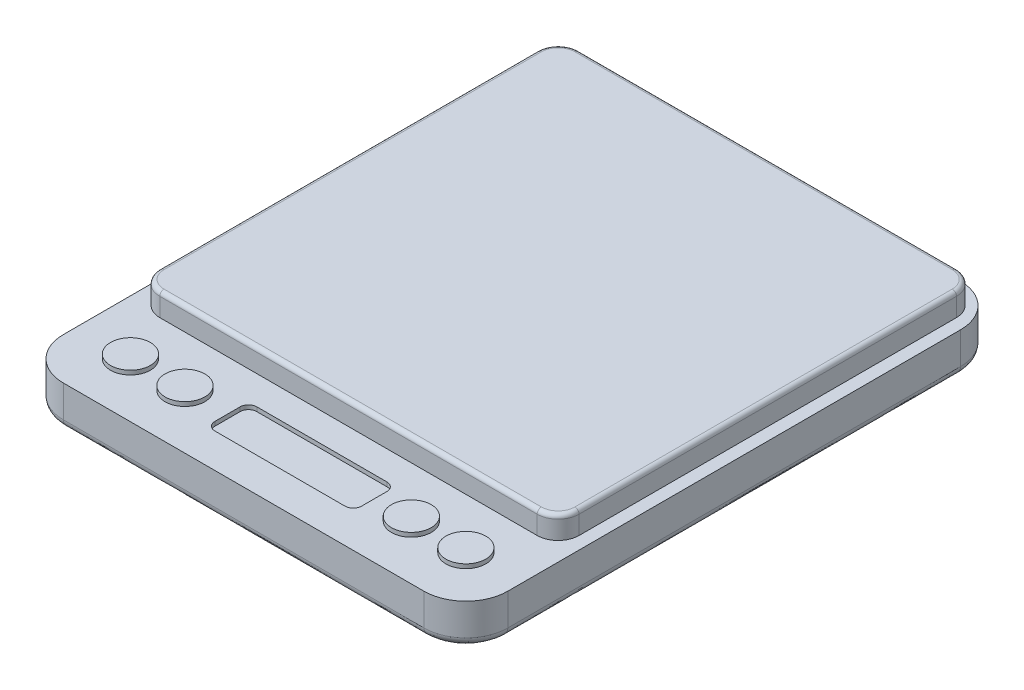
ISO-10303-21;
HEADER;
FILE_DESCRIPTION(('STEP AP214'),'2;1');
FILE_NAME('part.step','',(''),(''),'','','');
FILE_SCHEMA(('AUTOMOTIVE_DESIGN { 1 0 10303 214 1 1 1 1 }'));
ENDSEC;
DATA;
#1=APPLICATION_CONTEXT('core data for automotive mechanical design processes');
#2=APPLICATION_PROTOCOL_DEFINITION('international standard','automotive_design',2000,#1);
#3=PRODUCT_CONTEXT('',#1,'mechanical');
#4=PRODUCT('Part','Part','',(#3));
#5=PRODUCT_RELATED_PRODUCT_CATEGORY('part','',(#4));
#6=PRODUCT_DEFINITION_FORMATION('','',#4);
#7=PRODUCT_DEFINITION_CONTEXT('part definition',#1,'design');
#8=PRODUCT_DEFINITION('design','',#6,#7);
#9=PRODUCT_DEFINITION_SHAPE('','',#8);
#10=(LENGTH_UNIT() NAMED_UNIT(*) SI_UNIT(.MILLI.,.METRE.));
#11=(NAMED_UNIT(*) PLANE_ANGLE_UNIT() SI_UNIT($,.RADIAN.));
#12=(NAMED_UNIT(*) SI_UNIT($,.STERADIAN.) SOLID_ANGLE_UNIT());
#13=UNCERTAINTY_MEASURE_WITH_UNIT(LENGTH_MEASURE(1.E-05),#10,'distance_accuracy_value','');
#14=(GEOMETRIC_REPRESENTATION_CONTEXT(3) GLOBAL_UNCERTAINTY_ASSIGNED_CONTEXT((#13)) GLOBAL_UNIT_ASSIGNED_CONTEXT((#10,
#11,#12)) REPRESENTATION_CONTEXT('',''));
#15=CARTESIAN_POINT('',(0.,0.,0.));
#16=DIRECTION('',(0.,0.,1.));
#17=DIRECTION('',(1.,0.,0.));
#18=AXIS2_PLACEMENT_3D('',#15,#16,#17);
#19=CARTESIAN_POINT('',(0.,10.6,0.));
#20=DIRECTION('',(0.,-1.,0.));
#21=DIRECTION('',(0.,0.,-1.));
#22=AXIS2_PLACEMENT_3D('',#19,#20,#21);
#23=PLANE('',#22);
#24=DIRECTION('',(1.,0.,0.));
#25=VECTOR('',#24,1.);
#26=CARTESIAN_POINT('',(0.,10.6,-18.1526533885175));
#27=LINE('',#26,#25);
#28=CARTESIAN_POINT('',(38.,10.6,-18.1526533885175));
#29=VERTEX_POINT('',#28);
#30=CARTESIAN_POINT('',(69.,10.6,-18.1526533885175));
#31=VERTEX_POINT('',#30);
#32=EDGE_CURVE('E297',#29,#31,#27,.T.);
#33=ORIENTED_EDGE('',*,*,#32,.T.);
#34=CARTESIAN_POINT('',(69.,10.6,-16.1526533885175));
#35=DIRECTION('',(0.,1.,0.));
#36=DIRECTION('',(0.,0.,1.));
#37=AXIS2_PLACEMENT_3D('',#34,#35,#36);
#38=CIRCLE('',#37,2.);
#39=CARTESIAN_POINT('',(71.,10.6,-16.1526533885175));
#40=VERTEX_POINT('',#39);
#41=EDGE_CURVE('E302',#31,#40,#38,.F.);
#42=ORIENTED_EDGE('',*,*,#41,.T.);
#43=DIRECTION('',(0.,0.,1.));
#44=VECTOR('',#43,1.);
#45=CARTESIAN_POINT('',(71.,10.6,0.));
#46=LINE('',#45,#44);
#47=CARTESIAN_POINT('',(71.,10.6,-10.1526533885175));
#48=VERTEX_POINT('',#47);
#49=EDGE_CURVE('E339',#40,#48,#46,.T.);
#50=ORIENTED_EDGE('',*,*,#49,.T.);
#51=CARTESIAN_POINT('',(69.,10.6,-10.1526533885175));
#52=DIRECTION('',(0.,1.,0.));
#53=DIRECTION('',(0.,0.,1.));
#54=AXIS2_PLACEMENT_3D('',#51,#52,#53);
#55=CIRCLE('',#54,2.);
#56=CARTESIAN_POINT('',(69.,10.6,-8.15265338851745));
#57=VERTEX_POINT('',#56);
#58=EDGE_CURVE('E336',#57,#48,#55,.T.);
#59=ORIENTED_EDGE('',*,*,#58,.F.);
#60=DIRECTION('',(1.,0.,0.));
#61=VECTOR('',#60,1.);
#62=CARTESIAN_POINT('',(0.,10.6,-8.15265338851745));
#63=LINE('',#62,#61);
#64=CARTESIAN_POINT('',(38.,10.6,-8.15265338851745));
#65=VERTEX_POINT('',#64);
#66=EDGE_CURVE('E333',#65,#57,#63,.T.);
#67=ORIENTED_EDGE('',*,*,#66,.F.);
#68=CARTESIAN_POINT('',(38.,10.6,-10.1526533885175));
#69=DIRECTION('',(0.,1.,0.));
#70=DIRECTION('',(0.,0.,1.));
#71=AXIS2_PLACEMENT_3D('',#68,#69,#70);
#72=CIRCLE('',#71,2.);
#73=CARTESIAN_POINT('',(36.,10.6,-10.1526533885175));
#74=VERTEX_POINT('',#73);
#75=EDGE_CURVE('E330',#74,#65,#72,.T.);
#76=ORIENTED_EDGE('',*,*,#75,.F.);
#77=DIRECTION('',(0.,0.,1.));
#78=VECTOR('',#77,1.);
#79=CARTESIAN_POINT('',(36.,10.6,0.));
#80=LINE('',#79,#78);
#81=CARTESIAN_POINT('',(36.,10.6,-16.1526533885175));
#82=VERTEX_POINT('',#81);
#83=EDGE_CURVE('E327',#82,#74,#80,.T.);
#84=ORIENTED_EDGE('',*,*,#83,.F.);
#85=CARTESIAN_POINT('',(38.,10.6,-16.1526533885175));
#86=DIRECTION('',(0.,1.,0.));
#87=DIRECTION('',(0.,0.,1.));
#88=AXIS2_PLACEMENT_3D('',#85,#86,#87);
#89=CIRCLE('',#88,2.);
#90=EDGE_CURVE('E324',#29,#82,#89,.T.);
#91=ORIENTED_EDGE('',*,*,#90,.F.);
#92=EDGE_LOOP('',(#33,#42,#50,#59,#67,#76,#84,#91));
#93=FACE_BOUND('',#92,.T.);
#94=CARTESIAN_POINT('',(80.,10.6,-13.));
#95=DIRECTION('',(0.,-1.,0.));
#96=DIRECTION('',(0.,0.,-1.));
#97=AXIS2_PLACEMENT_3D('',#94,#95,#96);
#98=CIRCLE('',#97,4.75000000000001);
#99=CARTESIAN_POINT('',(80.,10.6,-17.75));
#100=VERTEX_POINT('',#99);
#101=EDGE_CURVE('E795',#100,#100,#98,.F.);
#102=ORIENTED_EDGE('',*,*,#101,.F.);
#103=EDGE_LOOP('',(#102));
#104=FACE_BOUND('',#103,.T.);
#105=CARTESIAN_POINT('',(13.,10.6,-13.));
#106=DIRECTION('',(0.,-1.,0.));
#107=DIRECTION('',(0.,0.,-1.));
#108=AXIS2_PLACEMENT_3D('',#105,#106,#107);
#109=CIRCLE('',#108,4.75);
#110=CARTESIAN_POINT('',(13.,10.6,-17.75));
#111=VERTEX_POINT('',#110);
#112=EDGE_CURVE('E792',#111,#111,#109,.F.);
#113=ORIENTED_EDGE('',*,*,#112,.F.);
#114=EDGE_LOOP('',(#113));
#115=FACE_BOUND('',#114,.T.);
#116=CARTESIAN_POINT('',(26.,10.6,-13.));
#117=DIRECTION('',(0.,-1.,0.));
#118=DIRECTION('',(0.,0.,-1.));
#119=AXIS2_PLACEMENT_3D('',#116,#117,#118);
#120=CIRCLE('',#119,4.75);
#121=CARTESIAN_POINT('',(26.,10.6,-17.75));
#122=VERTEX_POINT('',#121);
#123=EDGE_CURVE('E788',#122,#122,#120,.F.);
#124=ORIENTED_EDGE('',*,*,#123,.F.);
#125=EDGE_LOOP('',(#124));
#126=FACE_BOUND('',#125,.T.);
#127=CARTESIAN_POINT('',(93.,10.6,-13.));
#128=DIRECTION('',(0.,-1.,0.));
#129=DIRECTION('',(0.,0.,-1.));
#130=AXIS2_PLACEMENT_3D('',#127,#128,#129);
#131=CIRCLE('',#130,4.75000000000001);
#132=CARTESIAN_POINT('',(93.,10.6,-17.75));
#133=VERTEX_POINT('',#132);
#134=EDGE_CURVE('E780',#133,#133,#131,.F.);
#135=ORIENTED_EDGE('',*,*,#134,.F.);
#136=EDGE_LOOP('',(#135));
#137=FACE_BOUND('',#136,.T.);
#138=DIRECTION('',(-1.,0.,0.));
#139=VECTOR('',#138,1.);
#140=CARTESIAN_POINT('',(0.,10.6,-128.));
#141=LINE('',#140,#139);
#142=CARTESIAN_POINT('',(96.,10.6,-128.));
#143=VERTEX_POINT('',#142);
#144=CARTESIAN_POINT('',(10.,10.6,-128.));
#145=VERTEX_POINT('',#144);
#146=EDGE_CURVE('E382',#143,#145,#141,.T.);
#147=ORIENTED_EDGE('',*,*,#146,.T.);
#148=CARTESIAN_POINT('',(10.,10.6,-118.));
#149=DIRECTION('',(0.,-1.,0.));
#150=DIRECTION('',(0.,0.,-1.));
#151=AXIS2_PLACEMENT_3D('',#148,#149,#150);
#152=CIRCLE('',#151,10.);
#153=CARTESIAN_POINT('',(0.,10.6,-118.));
#154=VERTEX_POINT('',#153);
#155=EDGE_CURVE('E536',#145,#154,#152,.F.);
#156=ORIENTED_EDGE('',*,*,#155,.T.);
#157=DIRECTION('',(0.,0.,1.));
#158=VECTOR('',#157,1.);
#159=CARTESIAN_POINT('',(0.,10.6,0.));
#160=LINE('',#159,#158);
#161=CARTESIAN_POINT('',(0.,10.6,-10.));
#162=VERTEX_POINT('',#161);
#163=EDGE_CURVE('E373',#154,#162,#160,.T.);
#164=ORIENTED_EDGE('',*,*,#163,.T.);
#165=CARTESIAN_POINT('',(10.,10.6,-10.));
#166=DIRECTION('',(0.,-1.,0.));
#167=DIRECTION('',(0.,0.,-1.));
#168=AXIS2_PLACEMENT_3D('',#165,#166,#167);
#169=CIRCLE('',#168,10.);
#170=CARTESIAN_POINT('',(10.,10.6,0.));
#171=VERTEX_POINT('',#170);
#172=EDGE_CURVE('E612',#162,#171,#169,.F.);
#173=ORIENTED_EDGE('',*,*,#172,.T.);
#174=DIRECTION('',(1.,0.,0.));
#175=VECTOR('',#174,1.);
#176=CARTESIAN_POINT('',(0.,10.6,0.));
#177=LINE('',#176,#175);
#178=CARTESIAN_POINT('',(96.,10.6,0.));
#179=VERTEX_POINT('',#178);
#180=EDGE_CURVE('E376',#171,#179,#177,.T.);
#181=ORIENTED_EDGE('',*,*,#180,.T.);
#182=CARTESIAN_POINT('',(96.,10.6,-10.));
#183=DIRECTION('',(0.,-1.,0.));
#184=DIRECTION('',(0.,0.,-1.));
#185=AXIS2_PLACEMENT_3D('',#182,#183,#184);
#186=CIRCLE('',#185,10.);
#187=CARTESIAN_POINT('',(106.,10.6,-10.));
#188=VERTEX_POINT('',#187);
#189=EDGE_CURVE('E604',#179,#188,#186,.F.);
#190=ORIENTED_EDGE('',*,*,#189,.T.);
#191=DIRECTION('',(0.,0.,-1.));
#192=VECTOR('',#191,1.);
#193=CARTESIAN_POINT('',(106.,10.6,0.));
#194=LINE('',#193,#192);
#195=CARTESIAN_POINT('',(106.,10.6,-118.));
#196=VERTEX_POINT('',#195);
#197=EDGE_CURVE('E379',#188,#196,#194,.T.);
#198=ORIENTED_EDGE('',*,*,#197,.T.);
#199=CARTESIAN_POINT('',(96.,10.6,-118.));
#200=DIRECTION('',(0.,-1.,0.));
#201=DIRECTION('',(0.,0.,-1.));
#202=AXIS2_PLACEMENT_3D('',#199,#200,#201);
#203=CIRCLE('',#202,10.);
#204=EDGE_CURVE('E613',#196,#143,#203,.F.);
#205=ORIENTED_EDGE('',*,*,#204,.T.);
#206=EDGE_LOOP('',(#147,#156,#164,#173,#181,#190,#198,#205));
#207=FACE_BOUND('',#206,.T.);
#208=CARTESIAN_POINT('',(8.00000000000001,10.6,-30.));
#209=DIRECTION('',(0.,1.,0.));
#210=DIRECTION('',(0.,0.,1.));
#211=AXIS2_PLACEMENT_3D('',#208,#209,#210);
#212=CIRCLE('',#211,5.);
#213=CARTESIAN_POINT('',(3.00000000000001,10.6,-30.));
#214=VERTEX_POINT('',#213);
#215=CARTESIAN_POINT('',(8.00000000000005,10.6,-25.));
#216=VERTEX_POINT('',#215);
#217=EDGE_CURVE('E258',#214,#216,#212,.T.);
#218=ORIENTED_EDGE('',*,*,#217,.F.);
#219=DIRECTION('',(0.,0.,1.));
#220=VECTOR('',#219,1.);
#221=CARTESIAN_POINT('',(3.,10.6,-120.));
#222=LINE('',#221,#220);
#223=CARTESIAN_POINT('',(3.,10.6,-120.));
#224=VERTEX_POINT('',#223);
#225=EDGE_CURVE('E265',#224,#214,#222,.T.);
#226=ORIENTED_EDGE('',*,*,#225,.F.);
#227=CARTESIAN_POINT('',(8.,10.6,-120.));
#228=DIRECTION('',(0.,1.,0.));
#229=DIRECTION('',(0.,0.,1.));
#230=AXIS2_PLACEMENT_3D('',#227,#228,#229);
#231=CIRCLE('',#230,5.);
#232=CARTESIAN_POINT('',(8.,10.6,-125.));
#233=VERTEX_POINT('',#232);
#234=EDGE_CURVE('E278',#233,#224,#231,.T.);
#235=ORIENTED_EDGE('',*,*,#234,.F.);
#236=DIRECTION('',(-1.,0.,0.));
#237=VECTOR('',#236,1.);
#238=CARTESIAN_POINT('',(8.00000000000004,10.6,-125.));
#239=LINE('',#238,#237);
#240=CARTESIAN_POINT('',(98.,10.6,-125.));
#241=VERTEX_POINT('',#240);
#242=EDGE_CURVE('E280',#241,#233,#239,.T.);
#243=ORIENTED_EDGE('',*,*,#242,.F.);
#244=CARTESIAN_POINT('',(98.,10.6,-120.));
#245=DIRECTION('',(0.,1.,0.));
#246=DIRECTION('',(0.,0.,-1.));
#247=AXIS2_PLACEMENT_3D('',#244,#245,#246);
#248=CIRCLE('',#247,5.);
#249=CARTESIAN_POINT('',(103.,10.6,-120.));
#250=VERTEX_POINT('',#249);
#251=EDGE_CURVE('E867',#250,#241,#248,.T.);
#252=ORIENTED_EDGE('',*,*,#251,.F.);
#253=DIRECTION('',(0.,0.,-1.));
#254=VECTOR('',#253,1.);
#255=CARTESIAN_POINT('',(103.,10.6,-120.));
#256=LINE('',#255,#254);
#257=CARTESIAN_POINT('',(103.,10.6,-30.));
#258=VERTEX_POINT('',#257);
#259=EDGE_CURVE('E865',#258,#250,#256,.T.);
#260=ORIENTED_EDGE('',*,*,#259,.F.);
#261=CARTESIAN_POINT('',(98.,10.6,-30.));
#262=DIRECTION('',(0.,1.,0.));
#263=DIRECTION('',(0.,0.,1.));
#264=AXIS2_PLACEMENT_3D('',#261,#262,#263);
#265=CIRCLE('',#264,5.);
#266=CARTESIAN_POINT('',(98.,10.6,-25.));
#267=VERTEX_POINT('',#266);
#268=EDGE_CURVE('E864',#267,#258,#265,.T.);
#269=ORIENTED_EDGE('',*,*,#268,.F.);
#270=DIRECTION('',(1.,0.,0.));
#271=VECTOR('',#270,1.);
#272=CARTESIAN_POINT('',(8.00000000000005,10.6,-25.));
#273=LINE('',#272,#271);
#274=EDGE_CURVE('E274',#216,#267,#273,.T.);
#275=ORIENTED_EDGE('',*,*,#274,.F.);
#276=EDGE_LOOP('',(#218,#226,#235,#243,#252,#260,#269,#275));
#277=FACE_BOUND('',#276,.T.);
#278=ADVANCED_FACE('F45',(#93,#104,#115,#126,#137,#207,#277),#23,.F.);
#279=CARTESIAN_POINT('',(106.,3.,-10.));
#280=CARTESIAN_POINT('',(106.,3.,-46.0000000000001));
#281=CARTESIAN_POINT('',(106.,3.,-82.));
#282=CARTESIAN_POINT('',(106.,3.,-118.));
#283=CARTESIAN_POINT('',(106.,0.,-10.));
#284=CARTESIAN_POINT('',(106.,0.,-46.));
#285=CARTESIAN_POINT('',(106.,0.,-82.));
#286=CARTESIAN_POINT('',(106.,0.,-118.));
#287=CARTESIAN_POINT('',(101.,0.,-10.));
#288=CARTESIAN_POINT('',(101.,0.,-46.0000000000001));
#289=CARTESIAN_POINT('',(101.,0.,-82.));
#290=CARTESIAN_POINT('',(101.,0.,-118.));
#291=(BOUNDED_SURFACE() B_SPLINE_SURFACE(2,3,((#279,#280,#281,#282),(#283,#284,#285,#286),(#287,
#288,#289,#290)),.UNSPECIFIED.,.F.,.F.,.F.) B_SPLINE_SURFACE_WITH_KNOTS((3,3),(4,4),(0.,1.),
(0.01,0.118),.UNSPECIFIED.) GEOMETRIC_REPRESENTATION_ITEM() RATIONAL_B_SPLINE_SURFACE(((1.,1.,
1.,1.),(0.707106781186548,0.707106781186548,0.707106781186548,0.707106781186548),(1.,1.,1.,1.))) REPRESENTATION_ITEM('') SURFACE());
#292=CARTESIAN_POINT('',(101.,0.,-10.));
#293=CARTESIAN_POINT('',(106.,0.,-10.));
#294=CARTESIAN_POINT('',(106.,3.,-10.));
#295=(BOUNDED_CURVE() B_SPLINE_CURVE(2,(#292,#293,#294),.UNSPECIFIED.,.F.,
.F.) B_SPLINE_CURVE_WITH_KNOTS((3,3),(0.,1.),
.UNSPECIFIED.) CURVE() GEOMETRIC_REPRESENTATION_ITEM() RATIONAL_B_SPLINE_CURVE((1.,
0.707106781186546,1.)) REPRESENTATION_ITEM(''));
#296=CARTESIAN_POINT('',(101.,0.,-10.));
#297=VERTEX_POINT('',#296);
#298=CARTESIAN_POINT('',(106.,3.,-10.));
#299=VERTEX_POINT('',#298);
#300=EDGE_CURVE('E789',#297,#299,#295,.T.);
#301=CARTESIAN_POINT('',(101.,0.,-10.));
#302=CARTESIAN_POINT('',(101.,0.,-46.0000000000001));
#303=CARTESIAN_POINT('',(101.,0.,-82.));
#304=CARTESIAN_POINT('',(101.,0.,-118.));
#305=(BOUNDED_CURVE() B_SPLINE_CURVE(3,(#301,#302,#303,#304),.UNSPECIFIED.,.F.,
.F.) B_SPLINE_CURVE_WITH_KNOTS((4,4),(0.01,0.118),
.UNSPECIFIED.) CURVE() GEOMETRIC_REPRESENTATION_ITEM() RATIONAL_B_SPLINE_CURVE((1.,1.,1.,1.)) REPRESENTATION_ITEM(''));
#306=CARTESIAN_POINT('',(101.,0.,-118.));
#307=VERTEX_POINT('',#306);
#308=EDGE_CURVE('E450',#307,#297,#305,.F.);
#309=CARTESIAN_POINT('',(101.,0.,-118.));
#310=CARTESIAN_POINT('',(106.,0.,-118.));
#311=CARTESIAN_POINT('',(106.,3.,-118.));
#312=(BOUNDED_CURVE() B_SPLINE_CURVE(2,(#309,#310,#311),.UNSPECIFIED.,.F.,
.F.) B_SPLINE_CURVE_WITH_KNOTS((3,3),(0.,1.),
.UNSPECIFIED.) CURVE() GEOMETRIC_REPRESENTATION_ITEM() RATIONAL_B_SPLINE_CURVE((1.,
0.707106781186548,1.)) REPRESENTATION_ITEM(''));
#313=CARTESIAN_POINT('',(106.,3.,-118.));
#314=VERTEX_POINT('',#313);
#315=EDGE_CURVE('E1348',#307,#314,#312,.T.);
#316=CARTESIAN_POINT('',(106.,3.,-118.));
#317=CARTESIAN_POINT('',(106.,3.,-82.));
#318=CARTESIAN_POINT('',(106.,3.,-46.0000000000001));
#319=CARTESIAN_POINT('',(106.,3.,-10.));
#320=(BOUNDED_CURVE() B_SPLINE_CURVE(3,(#316,#317,#318,#319),.UNSPECIFIED.,.F.,
.F.) B_SPLINE_CURVE_WITH_KNOTS((4,4),(0.01,0.118),
.UNSPECIFIED.) CURVE() GEOMETRIC_REPRESENTATION_ITEM() RATIONAL_B_SPLINE_CURVE((1.,1.,1.,1.)) REPRESENTATION_ITEM(''));
#321=EDGE_CURVE('E567',#299,#314,#320,.F.);
#322=ORIENTED_EDGE('',*,*,#300,.F.);
#323=ORIENTED_EDGE('',*,*,#308,.F.);
#324=ORIENTED_EDGE('',*,*,#315,.T.);
#325=ORIENTED_EDGE('',*,*,#321,.F.);
#326=EDGE_LOOP('',(#322,#323,#324,#325));
#327=FACE_BOUND('',#326,.T.);
#328=ADVANCED_FACE('F728',(#327),#291,.T.);
#329=CARTESIAN_POINT('',(96.,0.,-123.));
#330=CARTESIAN_POINT('',(97.3126735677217,0.,-122.999999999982));
#331=CARTESIAN_POINT('',(98.6099332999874,0.,-122.461134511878));
#332=CARTESIAN_POINT('',(100.461134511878,0.,-120.609933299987));
#333=CARTESIAN_POINT('',(100.999999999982,0.,-119.312673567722));
#334=CARTESIAN_POINT('',(101.,0.,-118.));
#335=CARTESIAN_POINT('',(96.,0.,-128.));
#336=CARTESIAN_POINT('',(98.6253471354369,0.,-128.000000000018));
#337=CARTESIAN_POINT('',(101.219866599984,-1.07860516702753E-11,-126.922269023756));
#338=CARTESIAN_POINT('',(104.922269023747,1.07860516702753E-11,-123.219866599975));
#339=CARTESIAN_POINT('',(105.999999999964,-1.51089423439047E-11,-120.625347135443));
#340=CARTESIAN_POINT('',(106.,0.,-118.));
#341=CARTESIAN_POINT('',(96.,3.,-128.));
#342=CARTESIAN_POINT('',(98.6253471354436,3.,-128.));
#343=CARTESIAN_POINT('',(101.219866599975,3.,-126.922269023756));
#344=CARTESIAN_POINT('',(104.922269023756,3.,-123.219866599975));
#345=CARTESIAN_POINT('',(106.,3.,-120.625347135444));
#346=CARTESIAN_POINT('',(106.,3.,-118.));
#347=(BOUNDED_SURFACE() B_SPLINE_SURFACE(2,3,((#329,#330,#331,#332,#333,#334),(#335,#336,#337,
#338,#339,#340),(#341,#342,#343,#344,#345,#346)),.UNSPECIFIED.,.F.,.F.,
.F.) B_SPLINE_SURFACE_WITH_KNOTS((3,3),(4,2,4),(0.,1.),(0.,0.785398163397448,1.5707963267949),
.UNSPECIFIED.) GEOMETRIC_REPRESENTATION_ITEM() RATIONAL_B_SPLINE_SURFACE(((1.,1.,1.,1.,1.,1.),
(0.707106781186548,0.707106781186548,0.707106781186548,0.707106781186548,0.707106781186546,
0.707106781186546),(1.,1.,1.,1.,1.,1.))) REPRESENTATION_ITEM('') SURFACE());
#348=CARTESIAN_POINT('',(101.,0.,-118.));
#349=CARTESIAN_POINT('',(100.999999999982,0.,-119.312673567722));
#350=CARTESIAN_POINT('',(100.461134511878,0.,-120.609933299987));
#351=CARTESIAN_POINT('',(98.6099332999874,0.,-122.461134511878));
#352=CARTESIAN_POINT('',(97.3126735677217,0.,-122.999999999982));
#353=CARTESIAN_POINT('',(96.,0.,-123.));
#354=(BOUNDED_CURVE() B_SPLINE_CURVE(3,(#348,#349,#350,#351,#352,#353),.UNSPECIFIED.,.F.,
.F.) B_SPLINE_CURVE_WITH_KNOTS((4,2,4),(0.,0.785398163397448,1.5707963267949),
.UNSPECIFIED.) CURVE() GEOMETRIC_REPRESENTATION_ITEM() RATIONAL_B_SPLINE_CURVE((1.,1.,1.,1.,1.,1.)) REPRESENTATION_ITEM(''));
#355=CARTESIAN_POINT('',(96.,0.,-123.));
#356=VERTEX_POINT('',#355);
#357=EDGE_CURVE('E1347',#356,#307,#354,.F.);
#358=CARTESIAN_POINT('',(96.,0.,-123.));
#359=CARTESIAN_POINT('',(96.,0.,-128.));
#360=CARTESIAN_POINT('',(96.,3.,-128.));
#361=(BOUNDED_CURVE() B_SPLINE_CURVE(2,(#358,#359,#360),.UNSPECIFIED.,.F.,
.F.) B_SPLINE_CURVE_WITH_KNOTS((3,3),(0.,1.),
.UNSPECIFIED.) CURVE() GEOMETRIC_REPRESENTATION_ITEM() RATIONAL_B_SPLINE_CURVE((1.,
0.707106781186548,1.)) REPRESENTATION_ITEM(''));
#362=CARTESIAN_POINT('',(96.,3.,-128.));
#363=VERTEX_POINT('',#362);
#364=EDGE_CURVE('E708',#356,#363,#361,.T.);
#365=CARTESIAN_POINT('',(96.,3.,-128.));
#366=CARTESIAN_POINT('',(98.6253471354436,3.,-128.));
#367=CARTESIAN_POINT('',(101.219866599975,3.,-126.922269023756));
#368=CARTESIAN_POINT('',(104.922269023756,3.,-123.219866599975));
#369=CARTESIAN_POINT('',(106.,3.,-120.625347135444));
#370=CARTESIAN_POINT('',(106.,3.,-118.));
#371=(BOUNDED_CURVE() B_SPLINE_CURVE(3,(#365,#366,#367,#368,#369,#370),.UNSPECIFIED.,.F.,
.F.) B_SPLINE_CURVE_WITH_KNOTS((4,2,4),(0.,0.785398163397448,1.5707963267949),
.UNSPECIFIED.) CURVE() GEOMETRIC_REPRESENTATION_ITEM() RATIONAL_B_SPLINE_CURVE((1.,1.,1.,1.,1.,1.)) REPRESENTATION_ITEM(''));
#372=EDGE_CURVE('E553',#314,#363,#371,.F.);
#373=ORIENTED_EDGE('',*,*,#315,.F.);
#374=ORIENTED_EDGE('',*,*,#357,.F.);
#375=ORIENTED_EDGE('',*,*,#364,.T.);
#376=ORIENTED_EDGE('',*,*,#372,.F.);
#377=EDGE_LOOP('',(#373,#374,#375,#376));
#378=FACE_BOUND('',#377,.T.);
#379=ADVANCED_FACE('F714',(#378),#347,.T.);
#380=CARTESIAN_POINT('',(96.,3.,-128.));
#381=CARTESIAN_POINT('',(67.3333333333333,3.,-128.));
#382=CARTESIAN_POINT('',(38.6666666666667,3.,-128.));
#383=CARTESIAN_POINT('',(10.,3.,-128.));
#384=CARTESIAN_POINT('',(96.,0.,-128.));
#385=CARTESIAN_POINT('',(67.3333333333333,0.,-128.));
#386=CARTESIAN_POINT('',(38.6666666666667,0.,-128.));
#387=CARTESIAN_POINT('',(10.,0.,-128.));
#388=CARTESIAN_POINT('',(96.,0.,-123.));
#389=CARTESIAN_POINT('',(67.3333333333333,0.,-123.));
#390=CARTESIAN_POINT('',(38.6666666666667,0.,-123.));
#391=CARTESIAN_POINT('',(10.,0.,-123.));
#392=(BOUNDED_SURFACE() B_SPLINE_SURFACE(2,3,((#380,#381,#382,#383),(#384,#385,#386,#387),(#388,
#389,#390,#391)),.UNSPECIFIED.,.F.,.F.,.F.) B_SPLINE_SURFACE_WITH_KNOTS((3,3),(4,4),(0.,1.),
(-0.096,-0.01),.UNSPECIFIED.) GEOMETRIC_REPRESENTATION_ITEM() RATIONAL_B_SPLINE_SURFACE(((1.,1.,
1.,1.),(0.707106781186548,0.707106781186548,0.707106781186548,0.707106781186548),(1.,1.,1.,1.))) REPRESENTATION_ITEM('') SURFACE());
#393=CARTESIAN_POINT('',(96.,0.,-123.));
#394=CARTESIAN_POINT('',(67.3333333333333,0.,-123.));
#395=CARTESIAN_POINT('',(38.6666666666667,0.,-123.));
#396=CARTESIAN_POINT('',(10.,0.,-123.));
#397=(BOUNDED_CURVE() B_SPLINE_CURVE(3,(#393,#394,#395,#396),.UNSPECIFIED.,.F.,
.F.) B_SPLINE_CURVE_WITH_KNOTS((4,4),(-0.096,-0.01),
.UNSPECIFIED.) CURVE() GEOMETRIC_REPRESENTATION_ITEM() RATIONAL_B_SPLINE_CURVE((1.,1.,1.,1.)) REPRESENTATION_ITEM(''));
#398=CARTESIAN_POINT('',(10.,0.,-123.));
#399=VERTEX_POINT('',#398);
#400=EDGE_CURVE('E1345',#399,#356,#397,.F.);
#401=CARTESIAN_POINT('',(10.,0.,-123.));
#402=CARTESIAN_POINT('',(10.,0.,-128.));
#403=CARTESIAN_POINT('',(10.,3.,-128.));
#404=(BOUNDED_CURVE() B_SPLINE_CURVE(2,(#401,#402,#403),.UNSPECIFIED.,.F.,
.F.) B_SPLINE_CURVE_WITH_KNOTS((3,3),(0.,1.),
.UNSPECIFIED.) CURVE() GEOMETRIC_REPRESENTATION_ITEM() RATIONAL_B_SPLINE_CURVE((1.,
0.707106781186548,1.)) REPRESENTATION_ITEM(''));
#405=CARTESIAN_POINT('',(10.,3.,-128.));
#406=VERTEX_POINT('',#405);
#407=EDGE_CURVE('E640',#399,#406,#404,.T.);
#408=CARTESIAN_POINT('',(10.,3.,-128.));
#409=CARTESIAN_POINT('',(38.6666666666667,3.,-128.));
#410=CARTESIAN_POINT('',(67.3333333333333,3.,-128.));
#411=CARTESIAN_POINT('',(96.,3.,-128.));
#412=(BOUNDED_CURVE() B_SPLINE_CURVE(3,(#408,#409,#410,#411),.UNSPECIFIED.,.F.,
.F.) B_SPLINE_CURVE_WITH_KNOTS((4,4),(-0.096,-0.01),
.UNSPECIFIED.) CURVE() GEOMETRIC_REPRESENTATION_ITEM() RATIONAL_B_SPLINE_CURVE((1.,1.,1.,1.)) REPRESENTATION_ITEM(''));
#413=EDGE_CURVE('E633',#363,#406,#412,.F.);
#414=ORIENTED_EDGE('',*,*,#364,.F.);
#415=ORIENTED_EDGE('',*,*,#400,.F.);
#416=ORIENTED_EDGE('',*,*,#407,.T.);
#417=ORIENTED_EDGE('',*,*,#413,.F.);
#418=EDGE_LOOP('',(#414,#415,#416,#417));
#419=FACE_BOUND('',#418,.T.);
#420=ADVANCED_FACE('F674',(#419),#392,.T.);
#421=CARTESIAN_POINT('',(5.,0.,-118.));
#422=CARTESIAN_POINT('',(5.00000000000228,0.,-119.312673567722));
#423=CARTESIAN_POINT('',(5.53886548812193,0.,-120.609933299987));
#424=CARTESIAN_POINT('',(7.3900667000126,0.,-122.461134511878));
#425=CARTESIAN_POINT('',(8.68732643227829,0.,-122.999999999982));
#426=CARTESIAN_POINT('',(10.,0.,-123.));
#427=CARTESIAN_POINT('',(0.,0.,-118.));
#428=CARTESIAN_POINT('',(7.40065827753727E-12,0.,-120.625347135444));
#429=CARTESIAN_POINT('',(1.07773097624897,1.07869190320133E-11,-123.219866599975));
#430=CARTESIAN_POINT('',(4.78013340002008,-1.07851843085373E-11,-126.922269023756));
#431=CARTESIAN_POINT('',(7.37465286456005,0.,-128.000000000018));
#432=CARTESIAN_POINT('',(10.,0.,-128.));
#433=CARTESIAN_POINT('',(0.,3.,-118.));
#434=CARTESIAN_POINT('',(0.,3.,-120.625347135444));
#435=CARTESIAN_POINT('',(1.07773097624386,3.,-123.219866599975));
#436=CARTESIAN_POINT('',(4.78013340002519,3.,-126.922269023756));
#437=CARTESIAN_POINT('',(7.37465286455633,3.,-128.));
#438=CARTESIAN_POINT('',(10.,3.,-128.));
#439=(BOUNDED_SURFACE() B_SPLINE_SURFACE(2,3,((#421,#422,#423,#424,#425,#426),(#427,#428,#429,
#430,#431,#432),(#433,#434,#435,#436,#437,#438)),.UNSPECIFIED.,.F.,.F.,
.F.) B_SPLINE_SURFACE_WITH_KNOTS((3,3),(4,2,4),(0.,1.),(-1.5707963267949,-0.785398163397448,0.),
.UNSPECIFIED.) GEOMETRIC_REPRESENTATION_ITEM() RATIONAL_B_SPLINE_SURFACE(((1.,1.,1.,1.,1.,1.),
(0.707106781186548,0.707106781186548,0.707106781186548,0.707106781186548,0.707106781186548,
0.707106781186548),(1.,1.,1.,1.,1.,1.))) REPRESENTATION_ITEM('') SURFACE());
#440=CARTESIAN_POINT('',(10.,0.,-123.));
#441=CARTESIAN_POINT('',(8.68732643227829,0.,-122.999999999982));
#442=CARTESIAN_POINT('',(7.3900667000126,0.,-122.461134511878));
#443=CARTESIAN_POINT('',(5.53886548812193,0.,-120.609933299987));
#444=CARTESIAN_POINT('',(5.00000000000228,0.,-119.312673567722));
#445=CARTESIAN_POINT('',(5.,0.,-118.));
#446=(BOUNDED_CURVE() B_SPLINE_CURVE(3,(#440,#441,#442,#443,#444,#445),.UNSPECIFIED.,.F.,
.F.) B_SPLINE_CURVE_WITH_KNOTS((4,2,4),(-1.5707963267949,-0.785398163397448,0.),
.UNSPECIFIED.) CURVE() GEOMETRIC_REPRESENTATION_ITEM() RATIONAL_B_SPLINE_CURVE((1.,1.,1.,1.,1.,1.)) REPRESENTATION_ITEM(''));
#447=CARTESIAN_POINT('',(5.,0.,-118.));
#448=VERTEX_POINT('',#447);
#449=EDGE_CURVE('E1344',#448,#399,#446,.F.);
#450=CARTESIAN_POINT('',(5.,0.,-118.));
#451=CARTESIAN_POINT('',(0.,0.,-118.));
#452=CARTESIAN_POINT('',(0.,3.,-118.));
#453=(BOUNDED_CURVE() B_SPLINE_CURVE(2,(#450,#451,#452),.UNSPECIFIED.,.F.,
.F.) B_SPLINE_CURVE_WITH_KNOTS((3,3),(0.,1.),
.UNSPECIFIED.) CURVE() GEOMETRIC_REPRESENTATION_ITEM() RATIONAL_B_SPLINE_CURVE((1.,
0.707106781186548,1.)) REPRESENTATION_ITEM(''));
#454=CARTESIAN_POINT('',(0.,3.,-118.));
#455=VERTEX_POINT('',#454);
#456=EDGE_CURVE('E643',#448,#455,#453,.T.);
#457=CARTESIAN_POINT('',(0.,3.,-118.));
#458=CARTESIAN_POINT('',(0.,3.,-120.625347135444));
#459=CARTESIAN_POINT('',(1.07773097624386,3.,-123.219866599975));
#460=CARTESIAN_POINT('',(4.78013340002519,3.,-126.922269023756));
#461=CARTESIAN_POINT('',(7.37465286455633,3.,-128.));
#462=CARTESIAN_POINT('',(10.,3.,-128.));
#463=(BOUNDED_CURVE() B_SPLINE_CURVE(3,(#457,#458,#459,#460,#461,#462),.UNSPECIFIED.,.F.,
.F.) B_SPLINE_CURVE_WITH_KNOTS((4,2,4),(-1.5707963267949,-0.785398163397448,0.),
.UNSPECIFIED.) CURVE() GEOMETRIC_REPRESENTATION_ITEM() RATIONAL_B_SPLINE_CURVE((1.,1.,1.,1.,1.,1.)) REPRESENTATION_ITEM(''));
#464=EDGE_CURVE('E625',#406,#455,#463,.F.);
#465=ORIENTED_EDGE('',*,*,#407,.F.);
#466=ORIENTED_EDGE('',*,*,#449,.F.);
#467=ORIENTED_EDGE('',*,*,#456,.T.);
#468=ORIENTED_EDGE('',*,*,#464,.F.);
#469=EDGE_LOOP('',(#465,#466,#467,#468));
#470=FACE_BOUND('',#469,.T.);
#471=ADVANCED_FACE('F638',(#470),#439,.T.);
#472=CARTESIAN_POINT('',(0.,3.,-118.));
#473=CARTESIAN_POINT('',(0.,3.,-82.));
#474=CARTESIAN_POINT('',(0.,3.,-46.));
#475=CARTESIAN_POINT('',(0.,3.,-10.));
#476=CARTESIAN_POINT('',(0.,0.,-118.));
#477=CARTESIAN_POINT('',(-6.24500451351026E-11,0.,-82.));
#478=CARTESIAN_POINT('',(-1.56125112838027E-11,0.,-46.));
#479=CARTESIAN_POINT('',(0.,0.,-10.));
#480=CARTESIAN_POINT('',(5.,0.,-118.));
#481=CARTESIAN_POINT('',(5.,0.,-82.));
#482=CARTESIAN_POINT('',(5.,0.,-46.));
#483=CARTESIAN_POINT('',(5.,0.,-10.));
#484=(BOUNDED_SURFACE() B_SPLINE_SURFACE(2,3,((#472,#473,#474,#475),(#476,#477,#478,#479),(#480,
#481,#482,#483)),.UNSPECIFIED.,.F.,.F.,.F.) B_SPLINE_SURFACE_WITH_KNOTS((3,3),(4,4),(0.,1.),
(-0.118,-0.01),.UNSPECIFIED.) GEOMETRIC_REPRESENTATION_ITEM() RATIONAL_B_SPLINE_SURFACE(((1.,1.,
1.,1.),(0.707106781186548,0.707106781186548,0.707106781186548,0.707106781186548),(1.,1.,1.,1.))) REPRESENTATION_ITEM('') SURFACE());
#485=CARTESIAN_POINT('',(5.,0.,-118.));
#486=CARTESIAN_POINT('',(5.,0.,-82.));
#487=CARTESIAN_POINT('',(5.,0.,-46.));
#488=CARTESIAN_POINT('',(5.,0.,-10.));
#489=(BOUNDED_CURVE() B_SPLINE_CURVE(3,(#485,#486,#487,#488),.UNSPECIFIED.,.F.,
.F.) B_SPLINE_CURVE_WITH_KNOTS((4,4),(-0.118,-0.01),
.UNSPECIFIED.) CURVE() GEOMETRIC_REPRESENTATION_ITEM() RATIONAL_B_SPLINE_CURVE((1.,1.,1.,1.)) REPRESENTATION_ITEM(''));
#490=CARTESIAN_POINT('',(5.,0.,-10.));
#491=VERTEX_POINT('',#490);
#492=EDGE_CURVE('E1341',#491,#448,#489,.F.);
#493=CARTESIAN_POINT('',(5.,0.,-10.));
#494=CARTESIAN_POINT('',(0.,0.,-10.));
#495=CARTESIAN_POINT('',(0.,3.,-10.));
#496=(BOUNDED_CURVE() B_SPLINE_CURVE(2,(#493,#494,#495),.UNSPECIFIED.,.F.,
.F.) B_SPLINE_CURVE_WITH_KNOTS((3,3),(0.,1.),
.UNSPECIFIED.) CURVE() GEOMETRIC_REPRESENTATION_ITEM() RATIONAL_B_SPLINE_CURVE((1.,
0.707106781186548,1.)) REPRESENTATION_ITEM(''));
#497=CARTESIAN_POINT('',(0.,3.,-10.));
#498=VERTEX_POINT('',#497);
#499=EDGE_CURVE('E1366',#491,#498,#496,.T.);
#500=CARTESIAN_POINT('',(0.,3.,-10.));
#501=CARTESIAN_POINT('',(0.,3.,-46.));
#502=CARTESIAN_POINT('',(0.,3.,-82.));
#503=CARTESIAN_POINT('',(0.,3.,-118.));
#504=(BOUNDED_CURVE() B_SPLINE_CURVE(3,(#500,#501,#502,#503),.UNSPECIFIED.,.F.,
.F.) B_SPLINE_CURVE_WITH_KNOTS((4,4),(-0.118,-0.01),
.UNSPECIFIED.) CURVE() GEOMETRIC_REPRESENTATION_ITEM() RATIONAL_B_SPLINE_CURVE((1.,1.,1.,1.)) REPRESENTATION_ITEM(''));
#505=EDGE_CURVE('E645',#455,#498,#504,.F.);
#506=ORIENTED_EDGE('',*,*,#456,.F.);
#507=ORIENTED_EDGE('',*,*,#492,.F.);
#508=ORIENTED_EDGE('',*,*,#499,.T.);
#509=ORIENTED_EDGE('',*,*,#505,.F.);
#510=EDGE_LOOP('',(#506,#507,#508,#509));
#511=FACE_BOUND('',#510,.T.);
#512=ADVANCED_FACE('F673',(#511),#484,.T.);
#513=CARTESIAN_POINT('',(10.,0.,-5.));
#514=CARTESIAN_POINT('',(8.68732643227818,0.,-5.00000000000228));
#515=CARTESIAN_POINT('',(7.39006670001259,0.,-5.53886548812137));
#516=CARTESIAN_POINT('',(5.53886548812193,0.,-7.39006670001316));
#517=CARTESIAN_POINT('',(5.00000000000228,0.,-8.68732643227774));
#518=CARTESIAN_POINT('',(5.,0.,-10.));
#519=CARTESIAN_POINT('',(10.,0.,0.));
#520=CARTESIAN_POINT('',(7.37465286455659,0.,-5.12353265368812E-12));
#521=CARTESIAN_POINT('',(4.7801334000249,0.,-1.07773097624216));
#522=CARTESIAN_POINT('',(1.07773097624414,0.,-4.7801334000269));
#523=CARTESIAN_POINT('',(5.12353254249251E-12,0.,-7.37465286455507));
#524=CARTESIAN_POINT('',(0.,0.,-10.));
#525=CARTESIAN_POINT('',(10.,3.,0.));
#526=CARTESIAN_POINT('',(7.37465286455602,3.,0.));
#527=CARTESIAN_POINT('',(4.78013340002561,3.,-1.07773097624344));
#528=CARTESIAN_POINT('',(1.07773097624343,3.,-4.78013340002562));
#529=CARTESIAN_POINT('',(0.,3.,-7.374652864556));
#530=CARTESIAN_POINT('',(0.,3.,-10.));
#531=(BOUNDED_SURFACE() B_SPLINE_SURFACE(2,3,((#513,#514,#515,#516,#517,#518),(#519,#520,#521,
#522,#523,#524),(#525,#526,#527,#528,#529,#530)),.UNSPECIFIED.,.F.,.F.,
.F.) B_SPLINE_SURFACE_WITH_KNOTS((3,3),(4,2,4),(0.,1.),(3.14159265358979,3.92699081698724,
4.71238898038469),.UNSPECIFIED.) GEOMETRIC_REPRESENTATION_ITEM() RATIONAL_B_SPLINE_SURFACE(((1.,
1.,1.,1.,1.,1.),(0.707106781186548,0.707106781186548,0.707106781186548,0.707106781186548,
0.707106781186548,0.707106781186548),(1.,1.,1.,1.,1.,1.))) REPRESENTATION_ITEM('') SURFACE());
#532=CARTESIAN_POINT('',(5.,0.,-10.));
#533=CARTESIAN_POINT('',(5.00000000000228,0.,-8.68732643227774));
#534=CARTESIAN_POINT('',(5.53886548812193,0.,-7.39006670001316));
#535=CARTESIAN_POINT('',(7.39006670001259,0.,-5.53886548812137));
#536=CARTESIAN_POINT('',(8.68732643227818,0.,-5.00000000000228));
#537=CARTESIAN_POINT('',(10.,0.,-5.));
#538=(BOUNDED_CURVE() B_SPLINE_CURVE(3,(#532,#533,#534,#535,#536,#537),.UNSPECIFIED.,.F.,
.F.) B_SPLINE_CURVE_WITH_KNOTS((4,2,4),(3.14159265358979,3.92699081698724,4.71238898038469),
.UNSPECIFIED.) CURVE() GEOMETRIC_REPRESENTATION_ITEM() RATIONAL_B_SPLINE_CURVE((1.,1.,1.,1.,1.,1.)) REPRESENTATION_ITEM(''));
#539=CARTESIAN_POINT('',(10.,0.,-5.));
#540=VERTEX_POINT('',#539);
#541=EDGE_CURVE('E1338',#540,#491,#538,.F.);
#542=CARTESIAN_POINT('',(10.,0.,-5.));
#543=CARTESIAN_POINT('',(10.,0.,0.));
#544=CARTESIAN_POINT('',(10.,3.,0.));
#545=(BOUNDED_CURVE() B_SPLINE_CURVE(2,(#542,#543,#544),.UNSPECIFIED.,.F.,
.F.) B_SPLINE_CURVE_WITH_KNOTS((3,3),(0.,1.),
.UNSPECIFIED.) CURVE() GEOMETRIC_REPRESENTATION_ITEM() RATIONAL_B_SPLINE_CURVE((1.,
0.707106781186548,1.)) REPRESENTATION_ITEM(''));
#546=CARTESIAN_POINT('',(10.,3.,0.));
#547=VERTEX_POINT('',#546);
#548=EDGE_CURVE('E1367',#540,#547,#545,.T.);
#549=CARTESIAN_POINT('',(10.,3.,0.));
#550=CARTESIAN_POINT('',(7.37465286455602,3.,0.));
#551=CARTESIAN_POINT('',(4.78013340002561,3.,-1.07773097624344));
#552=CARTESIAN_POINT('',(1.07773097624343,3.,-4.78013340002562));
#553=CARTESIAN_POINT('',(0.,3.,-7.374652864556));
#554=CARTESIAN_POINT('',(0.,3.,-10.));
#555=(BOUNDED_CURVE() B_SPLINE_CURVE(3,(#549,#550,#551,#552,#553,#554),.UNSPECIFIED.,.F.,
.F.) B_SPLINE_CURVE_WITH_KNOTS((4,2,4),(3.14159265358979,3.92699081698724,4.71238898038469),
.UNSPECIFIED.) CURVE() GEOMETRIC_REPRESENTATION_ITEM() RATIONAL_B_SPLINE_CURVE((1.,1.,1.,1.,1.,1.)) REPRESENTATION_ITEM(''));
#556=EDGE_CURVE('E404',#498,#547,#555,.F.);
#557=ORIENTED_EDGE('',*,*,#499,.F.);
#558=ORIENTED_EDGE('',*,*,#541,.F.);
#559=ORIENTED_EDGE('',*,*,#548,.T.);
#560=ORIENTED_EDGE('',*,*,#556,.F.);
#561=EDGE_LOOP('',(#557,#558,#559,#560));
#562=FACE_BOUND('',#561,.T.);
#563=ADVANCED_FACE('F1228',(#562),#531,.T.);
#564=CARTESIAN_POINT('',(10.,3.,0.));
#565=CARTESIAN_POINT('',(38.6666666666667,3.,0.));
#566=CARTESIAN_POINT('',(67.3333333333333,3.,0.));
#567=CARTESIAN_POINT('',(96.,3.,0.));
#568=CARTESIAN_POINT('',(10.,0.,0.));
#569=CARTESIAN_POINT('',(38.6666666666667,0.,3.72956873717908E-11));
#570=CARTESIAN_POINT('',(67.3333333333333,0.,-1.24321849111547E-11));
#571=CARTESIAN_POINT('',(96.,0.,0.));
#572=CARTESIAN_POINT('',(10.,0.,-5.));
#573=CARTESIAN_POINT('',(38.6666666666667,0.,-5.));
#574=CARTESIAN_POINT('',(67.3333333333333,0.,-5.));
#575=CARTESIAN_POINT('',(96.,0.,-5.));
#576=(BOUNDED_SURFACE() B_SPLINE_SURFACE(2,3,((#564,#565,#566,#567),(#568,#569,#570,#571),(#572,
#573,#574,#575)),.UNSPECIFIED.,.F.,.F.,.F.) B_SPLINE_SURFACE_WITH_KNOTS((3,3),(4,4),(0.,1.),
(0.01,0.096),.UNSPECIFIED.) GEOMETRIC_REPRESENTATION_ITEM() RATIONAL_B_SPLINE_SURFACE(((1.,1.,
1.,1.),(0.707106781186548,0.707106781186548,0.707106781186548,0.707106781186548),(1.,1.,1.,1.))) REPRESENTATION_ITEM('') SURFACE());
#577=CARTESIAN_POINT('',(10.,0.,-5.));
#578=CARTESIAN_POINT('',(38.6666666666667,0.,-5.));
#579=CARTESIAN_POINT('',(67.3333333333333,0.,-5.));
#580=CARTESIAN_POINT('',(96.,0.,-5.));
#581=(BOUNDED_CURVE() B_SPLINE_CURVE(3,(#577,#578,#579,#580),.UNSPECIFIED.,.F.,
.F.) B_SPLINE_CURVE_WITH_KNOTS((4,4),(0.01,0.096),
.UNSPECIFIED.) CURVE() GEOMETRIC_REPRESENTATION_ITEM() RATIONAL_B_SPLINE_CURVE((1.,1.,1.,1.)) REPRESENTATION_ITEM(''));
#582=CARTESIAN_POINT('',(96.,0.,-5.));
#583=VERTEX_POINT('',#582);
#584=EDGE_CURVE('E1337',#583,#540,#581,.F.);
#585=CARTESIAN_POINT('',(96.,0.,-5.));
#586=CARTESIAN_POINT('',(96.,0.,0.));
#587=CARTESIAN_POINT('',(96.,3.,0.));
#588=(BOUNDED_CURVE() B_SPLINE_CURVE(2,(#585,#586,#587),.UNSPECIFIED.,.F.,
.F.) B_SPLINE_CURVE_WITH_KNOTS((3,3),(0.,1.),
.UNSPECIFIED.) CURVE() GEOMETRIC_REPRESENTATION_ITEM() RATIONAL_B_SPLINE_CURVE((1.,
0.707106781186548,1.)) REPRESENTATION_ITEM(''));
#589=CARTESIAN_POINT('',(96.,3.,0.));
#590=VERTEX_POINT('',#589);
#591=EDGE_CURVE('E1369',#583,#590,#588,.T.);
#592=CARTESIAN_POINT('',(96.,3.,0.));
#593=CARTESIAN_POINT('',(67.3333333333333,3.,0.));
#594=CARTESIAN_POINT('',(38.6666666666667,3.,0.));
#595=CARTESIAN_POINT('',(10.,3.,0.));
#596=(BOUNDED_CURVE() B_SPLINE_CURVE(3,(#592,#593,#594,#595),.UNSPECIFIED.,.F.,
.F.) B_SPLINE_CURVE_WITH_KNOTS((4,4),(0.01,0.096),
.UNSPECIFIED.) CURVE() GEOMETRIC_REPRESENTATION_ITEM() RATIONAL_B_SPLINE_CURVE((1.,1.,1.,1.)) REPRESENTATION_ITEM(''));
#597=EDGE_CURVE('E1336',#547,#590,#596,.F.);
#598=ORIENTED_EDGE('',*,*,#548,.F.);
#599=ORIENTED_EDGE('',*,*,#584,.F.);
#600=ORIENTED_EDGE('',*,*,#591,.T.);
#601=ORIENTED_EDGE('',*,*,#597,.F.);
#602=EDGE_LOOP('',(#598,#599,#600,#601));
#603=FACE_BOUND('',#602,.T.);
#604=ADVANCED_FACE('F431',(#603),#576,.T.);
#605=CARTESIAN_POINT('',(101.,0.,-10.));
#606=CARTESIAN_POINT('',(100.999999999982,0.,-8.68732643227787));
#607=CARTESIAN_POINT('',(100.461134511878,0.,-7.39006670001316));
#608=CARTESIAN_POINT('',(98.6099332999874,0.,-5.53886548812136));
#609=CARTESIAN_POINT('',(97.3126735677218,0.,-5.00000000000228));
#610=CARTESIAN_POINT('',(96.,0.,-5.));
#611=CARTESIAN_POINT('',(106.,0.,-10.));
#612=CARTESIAN_POINT('',(105.999999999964,-1.51089423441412E-11,-7.37465286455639));
#613=CARTESIAN_POINT('',(104.922269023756,5.67686930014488E-13,-4.78013340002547));
#614=CARTESIAN_POINT('',(101.219866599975,-5.67686930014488E-13,-1.07773097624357));
#615=CARTESIAN_POINT('',(98.6253471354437,0.,-6.83050950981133E-12));
#616=CARTESIAN_POINT('',(96.,0.,0.));
#617=CARTESIAN_POINT('',(106.,3.,-10.));
#618=CARTESIAN_POINT('',(106.,3.,-7.37465286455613));
#619=CARTESIAN_POINT('',(104.922269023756,3.,-4.78013340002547));
#620=CARTESIAN_POINT('',(101.219866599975,3.,-1.07773097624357));
#621=CARTESIAN_POINT('',(98.6253471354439,3.,0.));
#622=CARTESIAN_POINT('',(96.,3.,0.));
#623=(BOUNDED_SURFACE() B_SPLINE_SURFACE(2,3,((#605,#606,#607,#608,#609,#610),(#611,#612,#613,
#614,#615,#616),(#617,#618,#619,#620,#621,#622)),.UNSPECIFIED.,.F.,.F.,
.F.) B_SPLINE_SURFACE_WITH_KNOTS((3,3),(4,2,4),(0.,1.),(1.5707963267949,2.35619449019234,
3.14159265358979),.UNSPECIFIED.) GEOMETRIC_REPRESENTATION_ITEM() RATIONAL_B_SPLINE_SURFACE(((1.,
1.,1.,1.,1.,1.),(0.707106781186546,0.707106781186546,0.707106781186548,0.707106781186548,
0.707106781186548,0.707106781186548),(1.,1.,1.,1.,1.,1.))) REPRESENTATION_ITEM('') SURFACE());
#624=CARTESIAN_POINT('',(96.,0.,-5.));
#625=CARTESIAN_POINT('',(97.3126735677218,0.,-5.00000000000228));
#626=CARTESIAN_POINT('',(98.6099332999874,0.,-5.53886548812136));
#627=CARTESIAN_POINT('',(100.461134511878,0.,-7.39006670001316));
#628=CARTESIAN_POINT('',(100.999999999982,0.,-8.68732643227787));
#629=CARTESIAN_POINT('',(101.,0.,-10.));
#630=(BOUNDED_CURVE() B_SPLINE_CURVE(3,(#624,#625,#626,#627,#628,#629),.UNSPECIFIED.,.F.,
.F.) B_SPLINE_CURVE_WITH_KNOTS((4,2,4),(1.5707963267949,2.35619449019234,3.14159265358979),
.UNSPECIFIED.) CURVE() GEOMETRIC_REPRESENTATION_ITEM() RATIONAL_B_SPLINE_CURVE((1.,1.,1.,1.,1.,1.)) REPRESENTATION_ITEM(''));
#631=EDGE_CURVE('E522',#297,#583,#630,.F.);
#632=CARTESIAN_POINT('',(106.,3.,-10.));
#633=CARTESIAN_POINT('',(106.,3.,-7.37465286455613));
#634=CARTESIAN_POINT('',(104.922269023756,3.,-4.78013340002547));
#635=CARTESIAN_POINT('',(101.219866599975,3.,-1.07773097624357));
#636=CARTESIAN_POINT('',(98.6253471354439,3.,0.));
#637=CARTESIAN_POINT('',(96.,3.,0.));
#638=(BOUNDED_CURVE() B_SPLINE_CURVE(3,(#632,#633,#634,#635,#636,#637),.UNSPECIFIED.,.F.,
.F.) B_SPLINE_CURVE_WITH_KNOTS((4,2,4),(1.5707963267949,2.35619449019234,3.14159265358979),
.UNSPECIFIED.) CURVE() GEOMETRIC_REPRESENTATION_ITEM() RATIONAL_B_SPLINE_CURVE((1.,1.,1.,1.,1.,1.)) REPRESENTATION_ITEM(''));
#639=EDGE_CURVE('E1334',#590,#299,#638,.F.);
#640=ORIENTED_EDGE('',*,*,#631,.F.);
#641=ORIENTED_EDGE('',*,*,#300,.T.);
#642=ORIENTED_EDGE('',*,*,#639,.F.);
#643=ORIENTED_EDGE('',*,*,#591,.F.);
#644=EDGE_LOOP('',(#640,#641,#642,#643));
#645=FACE_BOUND('',#644,.T.);
#646=ADVANCED_FACE('F588',(#645),#623,.T.);
#647=CARTESIAN_POINT('',(0.,10.6,0.));
#648=DIRECTION('',(1.,0.,0.));
#649=DIRECTION('',(0.,0.,-1.));
#650=AXIS2_PLACEMENT_3D('',#647,#648,#649);
#651=PLANE('',#650);
#652=DIRECTION('',(0.,-1.,0.));
#653=VECTOR('',#652,1.);
#654=CARTESIAN_POINT('',(0.,10.6,-118.));
#655=LINE('',#654,#653);
#656=EDGE_CURVE('E393',#154,#455,#655,.T.);
#657=ORIENTED_EDGE('',*,*,#656,.T.);
#658=ORIENTED_EDGE('',*,*,#505,.T.);
#659=DIRECTION('',(0.,-1.,0.));
#660=VECTOR('',#659,1.);
#661=CARTESIAN_POINT('',(0.,10.6,-10.));
#662=LINE('',#661,#660);
#663=EDGE_CURVE('E385',#498,#162,#662,.F.);
#664=ORIENTED_EDGE('',*,*,#663,.T.);
#665=ORIENTED_EDGE('',*,*,#163,.F.);
#666=EDGE_LOOP('',(#657,#658,#664,#665));
#667=FACE_BOUND('',#666,.T.);
#668=ADVANCED_FACE('F584',(#667),#651,.F.);
#669=CARTESIAN_POINT('',(0.,10.6,0.));
#670=DIRECTION('',(0.,0.,-1.));
#671=DIRECTION('',(-1.,0.,0.));
#672=AXIS2_PLACEMENT_3D('',#669,#670,#671);
#673=PLANE('',#672);
#674=DIRECTION('',(0.,-1.,0.));
#675=VECTOR('',#674,1.);
#676=CARTESIAN_POINT('',(10.,10.6,0.));
#677=LINE('',#676,#675);
#678=EDGE_CURVE('E442',#171,#547,#677,.T.);
#679=ORIENTED_EDGE('',*,*,#678,.T.);
#680=ORIENTED_EDGE('',*,*,#597,.T.);
#681=DIRECTION('',(0.,-1.,0.));
#682=VECTOR('',#681,1.);
#683=CARTESIAN_POINT('',(96.,10.6,0.));
#684=LINE('',#683,#682);
#685=EDGE_CURVE('E451',#590,#179,#684,.F.);
#686=ORIENTED_EDGE('',*,*,#685,.T.);
#687=ORIENTED_EDGE('',*,*,#180,.F.);
#688=EDGE_LOOP('',(#679,#680,#686,#687));
#689=FACE_BOUND('',#688,.T.);
#690=ADVANCED_FACE('F580',(#689),#673,.F.);
#691=CARTESIAN_POINT('',(106.,10.6,0.));
#692=DIRECTION('',(-1.,0.,0.));
#693=DIRECTION('',(0.,0.,1.));
#694=AXIS2_PLACEMENT_3D('',#691,#692,#693);
#695=PLANE('',#694);
#696=DIRECTION('',(0.,-1.,0.));
#697=VECTOR('',#696,1.);
#698=CARTESIAN_POINT('',(106.,10.6,-10.));
#699=LINE('',#698,#697);
#700=EDGE_CURVE('E533',#188,#299,#699,.T.);
#701=ORIENTED_EDGE('',*,*,#700,.T.);
#702=ORIENTED_EDGE('',*,*,#321,.T.);
#703=DIRECTION('',(0.,-1.,0.));
#704=VECTOR('',#703,1.);
#705=CARTESIAN_POINT('',(106.,10.6,-118.));
#706=LINE('',#705,#704);
#707=EDGE_CURVE('E532',#314,#196,#706,.F.);
#708=ORIENTED_EDGE('',*,*,#707,.T.);
#709=ORIENTED_EDGE('',*,*,#197,.F.);
#710=EDGE_LOOP('',(#701,#702,#708,#709));
#711=FACE_BOUND('',#710,.T.);
#712=ADVANCED_FACE('F572',(#711),#695,.F.);
#713=CARTESIAN_POINT('',(0.,10.6,-128.));
#714=DIRECTION('',(0.,0.,1.));
#715=DIRECTION('',(1.,0.,0.));
#716=AXIS2_PLACEMENT_3D('',#713,#714,#715);
#717=PLANE('',#716);
#718=DIRECTION('',(0.,-1.,0.));
#719=VECTOR('',#718,1.);
#720=CARTESIAN_POINT('',(96.,10.6,-128.));
#721=LINE('',#720,#719);
#722=EDGE_CURVE('E605',#143,#363,#721,.T.);
#723=ORIENTED_EDGE('',*,*,#722,.T.);
#724=ORIENTED_EDGE('',*,*,#413,.T.);
#725=DIRECTION('',(0.,-1.,0.));
#726=VECTOR('',#725,1.);
#727=CARTESIAN_POINT('',(10.,10.6,-128.));
#728=LINE('',#727,#726);
#729=EDGE_CURVE('E596',#406,#145,#728,.F.);
#730=ORIENTED_EDGE('',*,*,#729,.T.);
#731=ORIENTED_EDGE('',*,*,#146,.F.);
#732=EDGE_LOOP('',(#723,#724,#730,#731));
#733=FACE_BOUND('',#732,.T.);
#734=ADVANCED_FACE('F480',(#733),#717,.F.);
#735=CARTESIAN_POINT('',(0.,0.,0.));
#736=DIRECTION('',(0.,-1.,0.));
#737=DIRECTION('',(0.,0.,-1.));
#738=AXIS2_PLACEMENT_3D('',#735,#736,#737);
#739=PLANE('',#738);
#740=ORIENTED_EDGE('',*,*,#308,.T.);
#741=ORIENTED_EDGE('',*,*,#631,.T.);
#742=ORIENTED_EDGE('',*,*,#584,.T.);
#743=ORIENTED_EDGE('',*,*,#541,.T.);
#744=ORIENTED_EDGE('',*,*,#492,.T.);
#745=ORIENTED_EDGE('',*,*,#449,.T.);
#746=ORIENTED_EDGE('',*,*,#400,.T.);
#747=ORIENTED_EDGE('',*,*,#357,.T.);
#748=EDGE_LOOP('',(#740,#741,#742,#743,#744,#745,#746,#747));
#749=FACE_BOUND('',#748,.T.);
#750=ADVANCED_FACE('F469',(#749),#739,.T.);
#751=CARTESIAN_POINT('',(10.,10.6,-118.));
#752=DIRECTION('',(0.,-1.,0.));
#753=DIRECTION('',(0.,0.,-1.));
#754=AXIS2_PLACEMENT_3D('',#751,#752,#753);
#755=CYLINDRICAL_SURFACE('',#754,10.);
#756=ORIENTED_EDGE('',*,*,#729,.F.);
#757=ORIENTED_EDGE('',*,*,#464,.T.);
#758=ORIENTED_EDGE('',*,*,#656,.F.);
#759=ORIENTED_EDGE('',*,*,#155,.F.);
#760=EDGE_LOOP('',(#756,#757,#758,#759));
#761=FACE_BOUND('',#760,.T.);
#762=ADVANCED_FACE('F479',(#761),#755,.T.);
#763=CARTESIAN_POINT('',(96.,10.6,-118.));
#764=DIRECTION('',(0.,-1.,0.));
#765=DIRECTION('',(0.,0.,-1.));
#766=AXIS2_PLACEMENT_3D('',#763,#764,#765);
#767=CYLINDRICAL_SURFACE('',#766,10.);
#768=ORIENTED_EDGE('',*,*,#707,.F.);
#769=ORIENTED_EDGE('',*,*,#372,.T.);
#770=ORIENTED_EDGE('',*,*,#722,.F.);
#771=ORIENTED_EDGE('',*,*,#204,.F.);
#772=EDGE_LOOP('',(#768,#769,#770,#771));
#773=FACE_BOUND('',#772,.T.);
#774=ADVANCED_FACE('F422',(#773),#767,.T.);
#775=CARTESIAN_POINT('',(10.,10.6,-10.));
#776=DIRECTION('',(0.,-1.,0.));
#777=DIRECTION('',(0.,0.,-1.));
#778=AXIS2_PLACEMENT_3D('',#775,#776,#777);
#779=CYLINDRICAL_SURFACE('',#778,10.);
#780=ORIENTED_EDGE('',*,*,#663,.F.);
#781=ORIENTED_EDGE('',*,*,#556,.T.);
#782=ORIENTED_EDGE('',*,*,#678,.F.);
#783=ORIENTED_EDGE('',*,*,#172,.F.);
#784=EDGE_LOOP('',(#780,#781,#782,#783));
#785=FACE_BOUND('',#784,.T.);
#786=ADVANCED_FACE('F411',(#785),#779,.T.);
#787=CARTESIAN_POINT('',(96.,10.6,-10.));
#788=DIRECTION('',(0.,-1.,0.));
#789=DIRECTION('',(0.,0.,-1.));
#790=AXIS2_PLACEMENT_3D('',#787,#788,#789);
#791=CYLINDRICAL_SURFACE('',#790,10.);
#792=ORIENTED_EDGE('',*,*,#685,.F.);
#793=ORIENTED_EDGE('',*,*,#639,.T.);
#794=ORIENTED_EDGE('',*,*,#700,.F.);
#795=ORIENTED_EDGE('',*,*,#189,.F.);
#796=EDGE_LOOP('',(#792,#793,#794,#795));
#797=FACE_BOUND('',#796,.T.);
#798=ADVANCED_FACE('F421',(#797),#791,.T.);
#799=CARTESIAN_POINT('',(93.,11.6,-13.));
#800=DIRECTION('',(0.,-1.,0.));
#801=DIRECTION('',(0.,0.,-1.));
#802=AXIS2_PLACEMENT_3D('',#799,#800,#801);
#803=CYLINDRICAL_SURFACE('',#802,4.75000000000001);
#804=CARTESIAN_POINT('',(93.,11.6,-13.));
#805=DIRECTION('',(0.,1.,0.));
#806=DIRECTION('',(0.,0.,1.));
#807=AXIS2_PLACEMENT_3D('',#804,#805,#806);
#808=CIRCLE('',#807,4.75000000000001);
#809=CARTESIAN_POINT('',(93.,11.6,-8.24999999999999));
#810=VERTEX_POINT('',#809);
#811=EDGE_CURVE('E370',#810,#810,#808,.T.);
#812=ORIENTED_EDGE('',*,*,#811,.F.);
#813=EDGE_LOOP('',(#812));
#814=FACE_BOUND('',#813,.T.);
#815=ORIENTED_EDGE('',*,*,#134,.T.);
#816=EDGE_LOOP('',(#815));
#817=FACE_BOUND('',#816,.T.);
#818=ADVANCED_FACE('F428',(#814,#817),#803,.T.);
#819=CARTESIAN_POINT('',(0.,11.6,0.));
#820=DIRECTION('',(0.,1.,0.));
#821=DIRECTION('',(0.,0.,1.));
#822=AXIS2_PLACEMENT_3D('',#819,#820,#821);
#823=PLANE('',#822);
#824=ORIENTED_EDGE('',*,*,#811,.T.);
#825=EDGE_LOOP('',(#824));
#826=FACE_BOUND('',#825,.T.);
#827=ADVANCED_FACE('F907',(#826),#823,.T.);
#828=CARTESIAN_POINT('',(26.,11.6,-13.));
#829=DIRECTION('',(0.,-1.,0.));
#830=DIRECTION('',(0.,0.,-1.));
#831=AXIS2_PLACEMENT_3D('',#828,#829,#830);
#832=CYLINDRICAL_SURFACE('',#831,4.75);
#833=CARTESIAN_POINT('',(26.,11.6,-13.));
#834=DIRECTION('',(0.,1.,0.));
#835=DIRECTION('',(0.,0.,1.));
#836=AXIS2_PLACEMENT_3D('',#833,#834,#835);
#837=CIRCLE('',#836,4.75);
#838=CARTESIAN_POINT('',(26.,11.6,-8.25));
#839=VERTEX_POINT('',#838);
#840=EDGE_CURVE('E367',#839,#839,#837,.T.);
#841=ORIENTED_EDGE('',*,*,#840,.F.);
#842=EDGE_LOOP('',(#841));
#843=FACE_BOUND('',#842,.T.);
#844=ORIENTED_EDGE('',*,*,#123,.T.);
#845=EDGE_LOOP('',(#844));
#846=FACE_BOUND('',#845,.T.);
#847=ADVANCED_FACE('F912',(#843,#846),#832,.T.);
#848=CARTESIAN_POINT('',(0.,11.6,0.));
#849=DIRECTION('',(0.,1.,0.));
#850=DIRECTION('',(0.,0.,1.));
#851=AXIS2_PLACEMENT_3D('',#848,#849,#850);
#852=PLANE('',#851);
#853=ORIENTED_EDGE('',*,*,#840,.T.);
#854=EDGE_LOOP('',(#853));
#855=FACE_BOUND('',#854,.T.);
#856=ADVANCED_FACE('F917',(#855),#852,.T.);
#857=CARTESIAN_POINT('',(13.,11.6,-13.));
#858=DIRECTION('',(0.,-1.,0.));
#859=DIRECTION('',(0.,0.,-1.));
#860=AXIS2_PLACEMENT_3D('',#857,#858,#859);
#861=CYLINDRICAL_SURFACE('',#860,4.75);
#862=CARTESIAN_POINT('',(13.,11.6,-13.));
#863=DIRECTION('',(0.,1.,0.));
#864=DIRECTION('',(0.,0.,1.));
#865=AXIS2_PLACEMENT_3D('',#862,#863,#864);
#866=CIRCLE('',#865,4.75);
#867=CARTESIAN_POINT('',(13.,11.6,-8.24999999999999));
#868=VERTEX_POINT('',#867);
#869=EDGE_CURVE('E364',#868,#868,#866,.T.);
#870=ORIENTED_EDGE('',*,*,#869,.F.);
#871=EDGE_LOOP('',(#870));
#872=FACE_BOUND('',#871,.T.);
#873=ORIENTED_EDGE('',*,*,#112,.T.);
#874=EDGE_LOOP('',(#873));
#875=FACE_BOUND('',#874,.T.);
#876=ADVANCED_FACE('F920',(#872,#875),#861,.T.);
#877=CARTESIAN_POINT('',(0.,11.6,0.));
#878=DIRECTION('',(0.,1.,0.));
#879=DIRECTION('',(0.,0.,1.));
#880=AXIS2_PLACEMENT_3D('',#877,#878,#879);
#881=PLANE('',#880);
#882=ORIENTED_EDGE('',*,*,#869,.T.);
#883=EDGE_LOOP('',(#882));
#884=FACE_BOUND('',#883,.T.);
#885=ADVANCED_FACE('F925',(#884),#881,.T.);
#886=CARTESIAN_POINT('',(80.,11.6,-13.));
#887=DIRECTION('',(0.,-1.,0.));
#888=DIRECTION('',(0.,0.,-1.));
#889=AXIS2_PLACEMENT_3D('',#886,#887,#888);
#890=CYLINDRICAL_SURFACE('',#889,4.75000000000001);
#891=CARTESIAN_POINT('',(80.,11.6,-13.));
#892=DIRECTION('',(0.,1.,0.));
#893=DIRECTION('',(0.,0.,1.));
#894=AXIS2_PLACEMENT_3D('',#891,#892,#893);
#895=CIRCLE('',#894,4.75000000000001);
#896=CARTESIAN_POINT('',(80.,11.6,-8.24999999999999));
#897=VERTEX_POINT('',#896);
#898=EDGE_CURVE('E347',#897,#897,#895,.T.);
#899=ORIENTED_EDGE('',*,*,#898,.F.);
#900=EDGE_LOOP('',(#899));
#901=FACE_BOUND('',#900,.T.);
#902=ORIENTED_EDGE('',*,*,#101,.T.);
#903=EDGE_LOOP('',(#902));
#904=FACE_BOUND('',#903,.T.);
#905=ADVANCED_FACE('F928',(#901,#904),#890,.T.);
#906=CARTESIAN_POINT('',(80.,11.6,-13.));
#907=DIRECTION('',(0.,1.,0.));
#908=DIRECTION('',(0.,0.,1.));
#909=AXIS2_PLACEMENT_3D('',#906,#907,#908);
#910=PLANE('',#909);
#911=ORIENTED_EDGE('',*,*,#898,.T.);
#912=EDGE_LOOP('',(#911));
#913=FACE_BOUND('',#912,.T.);
#914=ADVANCED_FACE('F933',(#913),#910,.T.);
#915=CARTESIAN_POINT('',(0.,9.6,-18.1526533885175));
#916=DIRECTION('',(0.,0.,1.));
#917=DIRECTION('',(1.,0.,0.));
#918=AXIS2_PLACEMENT_3D('',#915,#916,#917);
#919=PLANE('',#918);
#920=ORIENTED_EDGE('',*,*,#32,.F.);
#921=DIRECTION('',(0.,1.,0.));
#922=VECTOR('',#921,1.);
#923=CARTESIAN_POINT('',(38.,9.6,-18.1526533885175));
#924=LINE('',#923,#922);
#925=CARTESIAN_POINT('',(38.,9.6,-18.1526533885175));
#926=VERTEX_POINT('',#925);
#927=EDGE_CURVE('E321',#926,#29,#924,.T.);
#928=ORIENTED_EDGE('',*,*,#927,.F.);
#929=DIRECTION('',(1.,0.,0.));
#930=VECTOR('',#929,1.);
#931=CARTESIAN_POINT('',(0.,9.6,-18.1526533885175));
#932=LINE('',#931,#930);
#933=CARTESIAN_POINT('',(69.,9.6,-18.1526533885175));
#934=VERTEX_POINT('',#933);
#935=EDGE_CURVE('E298',#926,#934,#932,.T.);
#936=ORIENTED_EDGE('',*,*,#935,.T.);
#937=DIRECTION('',(0.,1.,0.));
#938=VECTOR('',#937,1.);
#939=CARTESIAN_POINT('',(69.,9.6,-18.1526533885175));
#940=LINE('',#939,#938);
#941=EDGE_CURVE('E344',#934,#31,#940,.T.);
#942=ORIENTED_EDGE('',*,*,#941,.T.);
#943=EDGE_LOOP('',(#920,#928,#936,#942));
#944=FACE_BOUND('',#943,.T.);
#945=ADVANCED_FACE('F936',(#944),#919,.T.);
#946=CARTESIAN_POINT('',(69.,9.6,-16.1526533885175));
#947=DIRECTION('',(0.,1.,0.));
#948=DIRECTION('',(0.,0.,1.));
#949=AXIS2_PLACEMENT_3D('',#946,#947,#948);
#950=CYLINDRICAL_SURFACE('',#949,2.);
#951=ORIENTED_EDGE('',*,*,#41,.F.);
#952=ORIENTED_EDGE('',*,*,#941,.F.);
#953=CARTESIAN_POINT('',(69.,9.6,-16.1526533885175));
#954=DIRECTION('',(0.,1.,0.));
#955=DIRECTION('',(0.,0.,1.));
#956=AXIS2_PLACEMENT_3D('',#953,#954,#955);
#957=CIRCLE('',#956,2.);
#958=CARTESIAN_POINT('',(71.,9.6,-16.1526533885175));
#959=VERTEX_POINT('',#958);
#960=EDGE_CURVE('E319',#934,#959,#957,.F.);
#961=ORIENTED_EDGE('',*,*,#960,.T.);
#962=DIRECTION('',(0.,1.,0.));
#963=VECTOR('',#962,1.);
#964=CARTESIAN_POINT('',(71.,9.6,-16.1526533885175));
#965=LINE('',#964,#963);
#966=EDGE_CURVE('E348',#959,#40,#965,.T.);
#967=ORIENTED_EDGE('',*,*,#966,.T.);
#968=EDGE_LOOP('',(#951,#952,#961,#967));
#969=FACE_BOUND('',#968,.T.);
#970=ADVANCED_FACE('F943',(#969),#950,.F.);
#971=CARTESIAN_POINT('',(71.,9.6,0.));
#972=DIRECTION('',(-1.,0.,0.));
#973=DIRECTION('',(0.,0.,1.));
#974=AXIS2_PLACEMENT_3D('',#971,#972,#973);
#975=PLANE('',#974);
#976=ORIENTED_EDGE('',*,*,#49,.F.);
#977=ORIENTED_EDGE('',*,*,#966,.F.);
#978=DIRECTION('',(0.,0.,1.));
#979=VECTOR('',#978,1.);
#980=CARTESIAN_POINT('',(71.,9.6,0.));
#981=LINE('',#980,#979);
#982=CARTESIAN_POINT('',(71.,9.6,-10.1526533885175));
#983=VERTEX_POINT('',#982);
#984=EDGE_CURVE('E317',#959,#983,#981,.T.);
#985=ORIENTED_EDGE('',*,*,#984,.T.);
#986=DIRECTION('',(0.,1.,0.));
#987=VECTOR('',#986,1.);
#988=CARTESIAN_POINT('',(71.,9.6,-10.1526533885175));
#989=LINE('',#988,#987);
#990=EDGE_CURVE('E350',#983,#48,#989,.T.);
#991=ORIENTED_EDGE('',*,*,#990,.T.);
#992=EDGE_LOOP('',(#976,#977,#985,#991));
#993=FACE_BOUND('',#992,.T.);
#994=ADVANCED_FACE('F965',(#993),#975,.T.);
#995=CARTESIAN_POINT('',(69.,9.6,-10.1526533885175));
#996=DIRECTION('',(0.,1.,0.));
#997=DIRECTION('',(0.,0.,1.));
#998=AXIS2_PLACEMENT_3D('',#995,#996,#997);
#999=CYLINDRICAL_SURFACE('',#998,2.);
#1000=ORIENTED_EDGE('',*,*,#58,.T.);
#1001=ORIENTED_EDGE('',*,*,#990,.F.);
#1002=CARTESIAN_POINT('',(69.,9.6,-10.1526533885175));
#1003=DIRECTION('',(0.,1.,0.));
#1004=DIRECTION('',(0.,0.,1.));
#1005=AXIS2_PLACEMENT_3D('',#1002,#1003,#1004);
#1006=CIRCLE('',#1005,2.);
#1007=CARTESIAN_POINT('',(69.,9.6,-8.15265338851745));
#1008=VERTEX_POINT('',#1007);
#1009=EDGE_CURVE('E314',#1008,#983,#1006,.T.);
#1010=ORIENTED_EDGE('',*,*,#1009,.F.);
#1011=DIRECTION('',(0.,1.,0.));
#1012=VECTOR('',#1011,1.);
#1013=CARTESIAN_POINT('',(69.,9.6,-8.15265338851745));
#1014=LINE('',#1013,#1012);
#1015=EDGE_CURVE('E352',#1008,#57,#1014,.T.);
#1016=ORIENTED_EDGE('',*,*,#1015,.T.);
#1017=EDGE_LOOP('',(#1000,#1001,#1010,#1016));
#1018=FACE_BOUND('',#1017,.T.);
#1019=ADVANCED_FACE('F961',(#1018),#999,.F.);
#1020=CARTESIAN_POINT('',(0.,9.6,-8.15265338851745));
#1021=DIRECTION('',(0.,0.,1.));
#1022=DIRECTION('',(1.,0.,0.));
#1023=AXIS2_PLACEMENT_3D('',#1020,#1021,#1022);
#1024=PLANE('',#1023);
#1025=ORIENTED_EDGE('',*,*,#66,.T.);
#1026=ORIENTED_EDGE('',*,*,#1015,.F.);
#1027=DIRECTION('',(1.,0.,0.));
#1028=VECTOR('',#1027,1.);
#1029=CARTESIAN_POINT('',(0.,9.6,-8.15265338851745));
#1030=LINE('',#1029,#1028);
#1031=CARTESIAN_POINT('',(38.,9.6,-8.15265338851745));
#1032=VERTEX_POINT('',#1031);
#1033=EDGE_CURVE('E311',#1032,#1008,#1030,.T.);
#1034=ORIENTED_EDGE('',*,*,#1033,.F.);
#1035=DIRECTION('',(0.,1.,0.));
#1036=VECTOR('',#1035,1.);
#1037=CARTESIAN_POINT('',(38.,9.6,-8.15265338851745));
#1038=LINE('',#1037,#1036);
#1039=EDGE_CURVE('E354',#1032,#65,#1038,.T.);
#1040=ORIENTED_EDGE('',*,*,#1039,.T.);
#1041=EDGE_LOOP('',(#1025,#1026,#1034,#1040));
#1042=FACE_BOUND('',#1041,.T.);
#1043=ADVANCED_FACE('F957',(#1042),#1024,.F.);
#1044=CARTESIAN_POINT('',(38.,9.6,-10.1526533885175));
#1045=DIRECTION('',(0.,1.,0.));
#1046=DIRECTION('',(0.,0.,1.));
#1047=AXIS2_PLACEMENT_3D('',#1044,#1045,#1046);
#1048=CYLINDRICAL_SURFACE('',#1047,2.);
#1049=ORIENTED_EDGE('',*,*,#75,.T.);
#1050=ORIENTED_EDGE('',*,*,#1039,.F.);
#1051=CARTESIAN_POINT('',(38.,9.6,-10.1526533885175));
#1052=DIRECTION('',(0.,1.,0.));
#1053=DIRECTION('',(0.,0.,1.));
#1054=AXIS2_PLACEMENT_3D('',#1051,#1052,#1053);
#1055=CIRCLE('',#1054,2.);
#1056=CARTESIAN_POINT('',(36.,9.6,-10.1526533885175));
#1057=VERTEX_POINT('',#1056);
#1058=EDGE_CURVE('E308',#1057,#1032,#1055,.T.);
#1059=ORIENTED_EDGE('',*,*,#1058,.F.);
#1060=DIRECTION('',(0.,1.,0.));
#1061=VECTOR('',#1060,1.);
#1062=CARTESIAN_POINT('',(36.,9.6,-10.1526533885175));
#1063=LINE('',#1062,#1061);
#1064=EDGE_CURVE('E356',#1057,#74,#1063,.T.);
#1065=ORIENTED_EDGE('',*,*,#1064,.T.);
#1066=EDGE_LOOP('',(#1049,#1050,#1059,#1065));
#1067=FACE_BOUND('',#1066,.T.);
#1068=ADVANCED_FACE('F953',(#1067),#1048,.F.);
#1069=CARTESIAN_POINT('',(36.,9.6,0.));
#1070=DIRECTION('',(-1.,0.,0.));
#1071=DIRECTION('',(0.,0.,1.));
#1072=AXIS2_PLACEMENT_3D('',#1069,#1070,#1071);
#1073=PLANE('',#1072);
#1074=ORIENTED_EDGE('',*,*,#83,.T.);
#1075=ORIENTED_EDGE('',*,*,#1064,.F.);
#1076=DIRECTION('',(0.,0.,1.));
#1077=VECTOR('',#1076,1.);
#1078=CARTESIAN_POINT('',(36.,9.6,0.));
#1079=LINE('',#1078,#1077);
#1080=CARTESIAN_POINT('',(36.,9.6,-16.1526533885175));
#1081=VERTEX_POINT('',#1080);
#1082=EDGE_CURVE('E305',#1081,#1057,#1079,.T.);
#1083=ORIENTED_EDGE('',*,*,#1082,.F.);
#1084=DIRECTION('',(0.,1.,0.));
#1085=VECTOR('',#1084,1.);
#1086=CARTESIAN_POINT('',(36.,9.6,-16.1526533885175));
#1087=LINE('',#1086,#1085);
#1088=EDGE_CURVE('E358',#1081,#82,#1087,.T.);
#1089=ORIENTED_EDGE('',*,*,#1088,.T.);
#1090=EDGE_LOOP('',(#1074,#1075,#1083,#1089));
#1091=FACE_BOUND('',#1090,.T.);
#1092=ADVANCED_FACE('F949',(#1091),#1073,.F.);
#1093=CARTESIAN_POINT('',(38.,9.6,-16.1526533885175));
#1094=DIRECTION('',(0.,1.,0.));
#1095=DIRECTION('',(0.,0.,1.));
#1096=AXIS2_PLACEMENT_3D('',#1093,#1094,#1095);
#1097=CYLINDRICAL_SURFACE('',#1096,2.);
#1098=ORIENTED_EDGE('',*,*,#90,.T.);
#1099=ORIENTED_EDGE('',*,*,#1088,.F.);
#1100=CARTESIAN_POINT('',(38.,9.6,-16.1526533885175));
#1101=DIRECTION('',(0.,1.,0.));
#1102=DIRECTION('',(0.,0.,1.));
#1103=AXIS2_PLACEMENT_3D('',#1100,#1101,#1102);
#1104=CIRCLE('',#1103,2.);
#1105=EDGE_CURVE('E301',#926,#1081,#1104,.T.);
#1106=ORIENTED_EDGE('',*,*,#1105,.F.);
#1107=ORIENTED_EDGE('',*,*,#927,.T.);
#1108=EDGE_LOOP('',(#1098,#1099,#1106,#1107));
#1109=FACE_BOUND('',#1108,.T.);
#1110=ADVANCED_FACE('F945',(#1109),#1097,.F.);
#1111=CARTESIAN_POINT('',(0.,9.6,0.));
#1112=DIRECTION('',(0.,1.,0.));
#1113=DIRECTION('',(0.,0.,1.));
#1114=AXIS2_PLACEMENT_3D('',#1111,#1112,#1113);
#1115=PLANE('',#1114);
#1116=ORIENTED_EDGE('',*,*,#935,.F.);
#1117=ORIENTED_EDGE('',*,*,#1105,.T.);
#1118=ORIENTED_EDGE('',*,*,#1082,.T.);
#1119=ORIENTED_EDGE('',*,*,#1058,.T.);
#1120=ORIENTED_EDGE('',*,*,#1033,.T.);
#1121=ORIENTED_EDGE('',*,*,#1009,.T.);
#1122=ORIENTED_EDGE('',*,*,#984,.F.);
#1123=ORIENTED_EDGE('',*,*,#960,.F.);
#1124=EDGE_LOOP('',(#1116,#1117,#1118,#1119,#1120,#1121,#1122,#1123));
#1125=FACE_BOUND('',#1124,.T.);
#1126=ADVANCED_FACE('F948',(#1125),#1115,.T.);
#1127=CARTESIAN_POINT('',(8.00000000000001,16.,-30.));
#1128=DIRECTION('',(0.,-1.,0.));
#1129=DIRECTION('',(0.,0.,-1.));
#1130=AXIS2_PLACEMENT_3D('',#1127,#1128,#1129);
#1131=CYLINDRICAL_SURFACE('',#1130,5.);
#1132=DIRECTION('',(0.,-1.,0.));
#1133=VECTOR('',#1132,1.);
#1134=CARTESIAN_POINT('',(8.00000000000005,16.,-25.));
#1135=LINE('',#1134,#1133);
#1136=CARTESIAN_POINT('',(8.00000000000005,15.,-25.));
#1137=VERTEX_POINT('',#1136);
#1138=EDGE_CURVE('E295',#1137,#216,#1135,.T.);
#1139=ORIENTED_EDGE('',*,*,#1138,.F.);
#1140=CARTESIAN_POINT('',(8.00000000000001,15.,-30.));
#1141=DIRECTION('',(0.,1.,0.));
#1142=DIRECTION('',(0.,0.,1.));
#1143=AXIS2_PLACEMENT_3D('',#1140,#1141,#1142);
#1144=CIRCLE('',#1143,5.);
#1145=CARTESIAN_POINT('',(3.00000000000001,15.,-30.));
#1146=VERTEX_POINT('',#1145);
#1147=EDGE_CURVE('E12',#1137,#1146,#1144,.F.);
#1148=ORIENTED_EDGE('',*,*,#1147,.T.);
#1149=DIRECTION('',(0.,-1.,0.));
#1150=VECTOR('',#1149,1.);
#1151=CARTESIAN_POINT('',(3.00000000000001,16.,-30.));
#1152=LINE('',#1151,#1150);
#1153=EDGE_CURVE('E255',#1146,#214,#1152,.T.);
#1154=ORIENTED_EDGE('',*,*,#1153,.T.);
#1155=ORIENTED_EDGE('',*,*,#217,.T.);
#1156=EDGE_LOOP('',(#1139,#1148,#1154,#1155));
#1157=FACE_BOUND('',#1156,.T.);
#1158=ADVANCED_FACE('F257',(#1157),#1131,.T.);
#1159=CARTESIAN_POINT('',(8.00000000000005,16.,-25.));
#1160=DIRECTION('',(0.,0.,-1.));
#1161=DIRECTION('',(-1.,0.,0.));
#1162=AXIS2_PLACEMENT_3D('',#1159,#1160,#1161);
#1163=PLANE('',#1162);
#1164=DIRECTION('',(0.,-1.,0.));
#1165=VECTOR('',#1164,1.);
#1166=CARTESIAN_POINT('',(98.,16.,-25.));
#1167=LINE('',#1166,#1165);
#1168=CARTESIAN_POINT('',(98.,15.,-25.));
#1169=VERTEX_POINT('',#1168);
#1170=EDGE_CURVE('E293',#1169,#267,#1167,.T.);
#1171=ORIENTED_EDGE('',*,*,#1170,.F.);
#1172=DIRECTION('',(1.,0.,0.));
#1173=VECTOR('',#1172,1.);
#1174=CARTESIAN_POINT('',(8.00000000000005,15.,-25.));
#1175=LINE('',#1174,#1173);
#1176=EDGE_CURVE('E54',#1169,#1137,#1175,.F.);
#1177=ORIENTED_EDGE('',*,*,#1176,.T.);
#1178=ORIENTED_EDGE('',*,*,#1138,.T.);
#1179=ORIENTED_EDGE('',*,*,#274,.T.);
#1180=EDGE_LOOP('',(#1171,#1177,#1178,#1179));
#1181=FACE_BOUND('',#1180,.T.);
#1182=ADVANCED_FACE('F978',(#1181),#1163,.F.);
#1183=CARTESIAN_POINT('',(98.,16.,-30.));
#1184=DIRECTION('',(0.,-1.,0.));
#1185=DIRECTION('',(0.,0.,-1.));
#1186=AXIS2_PLACEMENT_3D('',#1183,#1184,#1185);
#1187=CYLINDRICAL_SURFACE('',#1186,5.);
#1188=DIRECTION('',(0.,-1.,0.));
#1189=VECTOR('',#1188,1.);
#1190=CARTESIAN_POINT('',(103.,16.,-30.));
#1191=LINE('',#1190,#1189);
#1192=CARTESIAN_POINT('',(103.,15.,-30.));
#1193=VERTEX_POINT('',#1192);
#1194=EDGE_CURVE('E291',#1193,#258,#1191,.T.);
#1195=ORIENTED_EDGE('',*,*,#1194,.F.);
#1196=CARTESIAN_POINT('',(98.,15.,-30.));
#1197=DIRECTION('',(0.,1.,0.));
#1198=DIRECTION('',(0.,0.,1.));
#1199=AXIS2_PLACEMENT_3D('',#1196,#1197,#1198);
#1200=CIRCLE('',#1199,5.);
#1201=EDGE_CURVE('E69',#1193,#1169,#1200,.F.);
#1202=ORIENTED_EDGE('',*,*,#1201,.T.);
#1203=ORIENTED_EDGE('',*,*,#1170,.T.);
#1204=ORIENTED_EDGE('',*,*,#268,.T.);
#1205=EDGE_LOOP('',(#1195,#1202,#1203,#1204));
#1206=FACE_BOUND('',#1205,.T.);
#1207=ADVANCED_FACE('F863',(#1206),#1187,.T.);
#1208=CARTESIAN_POINT('',(103.,16.,-120.));
#1209=DIRECTION('',(-1.,0.,0.));
#1210=DIRECTION('',(0.,0.,1.));
#1211=AXIS2_PLACEMENT_3D('',#1208,#1209,#1210);
#1212=PLANE('',#1211);
#1213=DIRECTION('',(0.,-1.,0.));
#1214=VECTOR('',#1213,1.);
#1215=CARTESIAN_POINT('',(103.,16.,-120.));
#1216=LINE('',#1215,#1214);
#1217=CARTESIAN_POINT('',(103.,15.,-120.));
#1218=VERTEX_POINT('',#1217);
#1219=EDGE_CURVE('E289',#1218,#250,#1216,.T.);
#1220=ORIENTED_EDGE('',*,*,#1219,.F.);
#1221=DIRECTION('',(0.,0.,-1.));
#1222=VECTOR('',#1221,1.);
#1223=CARTESIAN_POINT('',(103.,15.,-30.));
#1224=LINE('',#1223,#1222);
#1225=EDGE_CURVE('E823',#1218,#1193,#1224,.F.);
#1226=ORIENTED_EDGE('',*,*,#1225,.T.);
#1227=ORIENTED_EDGE('',*,*,#1194,.T.);
#1228=ORIENTED_EDGE('',*,*,#259,.T.);
#1229=EDGE_LOOP('',(#1220,#1226,#1227,#1228));
#1230=FACE_BOUND('',#1229,.T.);
#1231=ADVANCED_FACE('F859',(#1230),#1212,.F.);
#1232=CARTESIAN_POINT('',(98.,16.,-120.));
#1233=DIRECTION('',(0.,-1.,0.));
#1234=DIRECTION('',(0.,0.,-1.));
#1235=AXIS2_PLACEMENT_3D('',#1232,#1233,#1234);
#1236=CYLINDRICAL_SURFACE('',#1235,5.);
#1237=DIRECTION('',(0.,-1.,0.));
#1238=VECTOR('',#1237,1.);
#1239=CARTESIAN_POINT('',(98.,16.,-125.));
#1240=LINE('',#1239,#1238);
#1241=CARTESIAN_POINT('',(98.,15.,-125.));
#1242=VERTEX_POINT('',#1241);
#1243=EDGE_CURVE('E287',#1242,#241,#1240,.T.);
#1244=ORIENTED_EDGE('',*,*,#1243,.F.);
#1245=CARTESIAN_POINT('',(98.,15.,-120.));
#1246=DIRECTION('',(0.,1.,0.));
#1247=DIRECTION('',(0.,0.,1.));
#1248=AXIS2_PLACEMENT_3D('',#1245,#1246,#1247);
#1249=CIRCLE('',#1248,5.);
#1250=EDGE_CURVE('E821',#1242,#1218,#1249,.F.);
#1251=ORIENTED_EDGE('',*,*,#1250,.T.);
#1252=ORIENTED_EDGE('',*,*,#1219,.T.);
#1253=ORIENTED_EDGE('',*,*,#251,.T.);
#1254=EDGE_LOOP('',(#1244,#1251,#1252,#1253));
#1255=FACE_BOUND('',#1254,.T.);
#1256=ADVANCED_FACE('F881',(#1255),#1236,.T.);
#1257=CARTESIAN_POINT('',(8.00000000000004,16.,-125.));
#1258=DIRECTION('',(0.,0.,1.));
#1259=DIRECTION('',(1.,0.,0.));
#1260=AXIS2_PLACEMENT_3D('',#1257,#1258,#1259);
#1261=PLANE('',#1260);
#1262=DIRECTION('',(0.,-1.,0.));
#1263=VECTOR('',#1262,1.);
#1264=CARTESIAN_POINT('',(8.00000000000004,16.,-125.));
#1265=LINE('',#1264,#1263);
#1266=CARTESIAN_POINT('',(8.00000000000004,15.,-125.));
#1267=VERTEX_POINT('',#1266);
#1268=EDGE_CURVE('E285',#1267,#233,#1265,.T.);
#1269=ORIENTED_EDGE('',*,*,#1268,.F.);
#1270=DIRECTION('',(-1.,0.,0.));
#1271=VECTOR('',#1270,1.);
#1272=CARTESIAN_POINT('',(98.,15.,-125.));
#1273=LINE('',#1272,#1271);
#1274=EDGE_CURVE('E819',#1267,#1242,#1273,.F.);
#1275=ORIENTED_EDGE('',*,*,#1274,.T.);
#1276=ORIENTED_EDGE('',*,*,#1243,.T.);
#1277=ORIENTED_EDGE('',*,*,#242,.T.);
#1278=EDGE_LOOP('',(#1269,#1275,#1276,#1277));
#1279=FACE_BOUND('',#1278,.T.);
#1280=ADVANCED_FACE('F876',(#1279),#1261,.F.);
#1281=CARTESIAN_POINT('',(8.,16.,-120.));
#1282=DIRECTION('',(0.,-1.,0.));
#1283=DIRECTION('',(0.,0.,-1.));
#1284=AXIS2_PLACEMENT_3D('',#1281,#1282,#1283);
#1285=CYLINDRICAL_SURFACE('',#1284,5.);
#1286=DIRECTION('',(0.,-1.,0.));
#1287=VECTOR('',#1286,1.);
#1288=CARTESIAN_POINT('',(3.,16.,-120.));
#1289=LINE('',#1288,#1287);
#1290=CARTESIAN_POINT('',(3.,15.,-120.));
#1291=VERTEX_POINT('',#1290);
#1292=EDGE_CURVE('E264',#1291,#224,#1289,.T.);
#1293=ORIENTED_EDGE('',*,*,#1292,.F.);
#1294=CARTESIAN_POINT('',(8.,15.,-120.));
#1295=DIRECTION('',(0.,1.,0.));
#1296=DIRECTION('',(0.,0.,1.));
#1297=AXIS2_PLACEMENT_3D('',#1294,#1295,#1296);
#1298=CIRCLE('',#1297,5.);
#1299=EDGE_CURVE('E817',#1291,#1267,#1298,.F.);
#1300=ORIENTED_EDGE('',*,*,#1299,.T.);
#1301=ORIENTED_EDGE('',*,*,#1268,.T.);
#1302=ORIENTED_EDGE('',*,*,#234,.T.);
#1303=EDGE_LOOP('',(#1293,#1300,#1301,#1302));
#1304=FACE_BOUND('',#1303,.T.);
#1305=ADVANCED_FACE('F888',(#1304),#1285,.T.);
#1306=CARTESIAN_POINT('',(3.,16.,-120.));
#1307=DIRECTION('',(1.,0.,0.));
#1308=DIRECTION('',(0.,0.,-1.));
#1309=AXIS2_PLACEMENT_3D('',#1306,#1307,#1308);
#1310=PLANE('',#1309);
#1311=ORIENTED_EDGE('',*,*,#1153,.F.);
#1312=DIRECTION('',(0.,0.,1.));
#1313=VECTOR('',#1312,1.);
#1314=CARTESIAN_POINT('',(3.,15.,-120.));
#1315=LINE('',#1314,#1313);
#1316=EDGE_CURVE('E815',#1146,#1291,#1315,.F.);
#1317=ORIENTED_EDGE('',*,*,#1316,.T.);
#1318=ORIENTED_EDGE('',*,*,#1292,.T.);
#1319=ORIENTED_EDGE('',*,*,#225,.T.);
#1320=EDGE_LOOP('',(#1311,#1317,#1318,#1319));
#1321=FACE_BOUND('',#1320,.T.);
#1322=ADVANCED_FACE('F276',(#1321),#1310,.F.);
#1323=CARTESIAN_POINT('',(8.00000000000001,16.,-30.));
#1324=DIRECTION('',(0.,1.,0.));
#1325=DIRECTION('',(0.,0.,1.));
#1326=AXIS2_PLACEMENT_3D('',#1323,#1324,#1325);
#1327=PLANE('',#1326);
#1328=CARTESIAN_POINT('',(8.,16.,-120.));
#1329=DIRECTION('',(0.,1.,0.));
#1330=DIRECTION('',(0.,0.,1.));
#1331=AXIS2_PLACEMENT_3D('',#1328,#1329,#1330);
#1332=CIRCLE('',#1331,4.);
#1333=CARTESIAN_POINT('',(8.00000000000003,16.,-124.));
#1334=VERTEX_POINT('',#1333);
#1335=CARTESIAN_POINT('',(4.,16.,-120.));
#1336=VERTEX_POINT('',#1335);
#1337=EDGE_CURVE('E810',#1334,#1336,#1332,.T.);
#1338=ORIENTED_EDGE('',*,*,#1337,.T.);
#1339=DIRECTION('',(0.,0.,1.));
#1340=VECTOR('',#1339,1.);
#1341=CARTESIAN_POINT('',(4.00000000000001,16.,-30.));
#1342=LINE('',#1341,#1340);
#1343=CARTESIAN_POINT('',(4.00000000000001,16.,-30.));
#1344=VERTEX_POINT('',#1343);
#1345=EDGE_CURVE('E812',#1336,#1344,#1342,.T.);
#1346=ORIENTED_EDGE('',*,*,#1345,.T.);
#1347=CARTESIAN_POINT('',(8.00000000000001,16.,-30.));
#1348=DIRECTION('',(0.,1.,0.));
#1349=DIRECTION('',(0.,0.,1.));
#1350=AXIS2_PLACEMENT_3D('',#1347,#1348,#1349);
#1351=CIRCLE('',#1350,4.);
#1352=CARTESIAN_POINT('',(8.00000000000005,16.,-26.));
#1353=VERTEX_POINT('',#1352);
#1354=EDGE_CURVE('E798',#1344,#1353,#1351,.T.);
#1355=ORIENTED_EDGE('',*,*,#1354,.T.);
#1356=DIRECTION('',(1.,0.,0.));
#1357=VECTOR('',#1356,1.);
#1358=CARTESIAN_POINT('',(98.,16.,-26.));
#1359=LINE('',#1358,#1357);
#1360=CARTESIAN_POINT('',(98.,16.,-26.));
#1361=VERTEX_POINT('',#1360);
#1362=EDGE_CURVE('E800',#1353,#1361,#1359,.T.);
#1363=ORIENTED_EDGE('',*,*,#1362,.T.);
#1364=CARTESIAN_POINT('',(98.,16.,-30.));
#1365=DIRECTION('',(0.,1.,0.));
#1366=DIRECTION('',(0.,0.,1.));
#1367=AXIS2_PLACEMENT_3D('',#1364,#1365,#1366);
#1368=CIRCLE('',#1367,4.);
#1369=CARTESIAN_POINT('',(102.,16.,-30.));
#1370=VERTEX_POINT('',#1369);
#1371=EDGE_CURVE('E802',#1361,#1370,#1368,.T.);
#1372=ORIENTED_EDGE('',*,*,#1371,.T.);
#1373=DIRECTION('',(0.,0.,-1.));
#1374=VECTOR('',#1373,1.);
#1375=CARTESIAN_POINT('',(102.,16.,-120.));
#1376=LINE('',#1375,#1374);
#1377=CARTESIAN_POINT('',(102.,16.,-120.));
#1378=VERTEX_POINT('',#1377);
#1379=EDGE_CURVE('E804',#1370,#1378,#1376,.T.);
#1380=ORIENTED_EDGE('',*,*,#1379,.T.);
#1381=CARTESIAN_POINT('',(98.,16.,-120.));
#1382=DIRECTION('',(0.,1.,0.));
#1383=DIRECTION('',(0.,0.,1.));
#1384=AXIS2_PLACEMENT_3D('',#1381,#1382,#1383);
#1385=CIRCLE('',#1384,4.);
#1386=CARTESIAN_POINT('',(98.,16.,-124.));
#1387=VERTEX_POINT('',#1386);
#1388=EDGE_CURVE('E806',#1378,#1387,#1385,.T.);
#1389=ORIENTED_EDGE('',*,*,#1388,.T.);
#1390=DIRECTION('',(-1.,0.,0.));
#1391=VECTOR('',#1390,1.);
#1392=CARTESIAN_POINT('',(8.00000000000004,16.,-124.));
#1393=LINE('',#1392,#1391);
#1394=EDGE_CURVE('E808',#1387,#1334,#1393,.T.);
#1395=ORIENTED_EDGE('',*,*,#1394,.T.);
#1396=EDGE_LOOP('',(#1338,#1346,#1355,#1363,#1372,#1380,#1389,#1395));
#1397=FACE_BOUND('',#1396,.T.);
#1398=ADVANCED_FACE('F1018',(#1397),#1327,.T.);
#1399=CARTESIAN_POINT('',(102.,15.,-30.));
#1400=DIRECTION('',(0.,0.,1.));
#1401=DIRECTION('',(1.,0.,0.));
#1402=AXIS2_PLACEMENT_3D('',#1399,#1400,#1401);
#1403=CYLINDRICAL_SURFACE('',#1402,1.);
#1404=CARTESIAN_POINT('',(102.,15.,-30.));
#1405=DIRECTION('',(0.,0.,1.));
#1406=DIRECTION('',(1.,0.,0.));
#1407=AXIS2_PLACEMENT_3D('',#1404,#1405,#1406);
#1408=CIRCLE('',#1407,1.);
#1409=EDGE_CURVE('E842',#1193,#1370,#1408,.T.);
#1410=ORIENTED_EDGE('',*,*,#1409,.F.);
#1411=ORIENTED_EDGE('',*,*,#1225,.F.);
#1412=CARTESIAN_POINT('',(102.,15.,-120.));
#1413=DIRECTION('',(0.,0.,-1.));
#1414=DIRECTION('',(-1.,0.,0.));
#1415=AXIS2_PLACEMENT_3D('',#1412,#1413,#1414);
#1416=CIRCLE('',#1415,1.);
#1417=EDGE_CURVE('E49',#1378,#1218,#1416,.T.);
#1418=ORIENTED_EDGE('',*,*,#1417,.F.);
#1419=ORIENTED_EDGE('',*,*,#1379,.F.);
#1420=EDGE_LOOP('',(#1410,#1411,#1418,#1419));
#1421=FACE_BOUND('',#1420,.T.);
#1422=ADVANCED_FACE('F47',(#1421),#1403,.T.);
#1423=CARTESIAN_POINT('',(98.,15.,-120.));
#1424=DIRECTION('',(0.,1.,0.));
#1425=DIRECTION('',(0.,0.,1.));
#1426=AXIS2_PLACEMENT_3D('',#1423,#1424,#1425);
#1427=TOROIDAL_SURFACE('',#1426,4.,1.);
#1428=ORIENTED_EDGE('',*,*,#1417,.T.);
#1429=ORIENTED_EDGE('',*,*,#1250,.F.);
#1430=CARTESIAN_POINT('',(98.,15.,-124.));
#1431=DIRECTION('',(-1.,0.,0.));
#1432=DIRECTION('',(0.,0.,1.));
#1433=AXIS2_PLACEMENT_3D('',#1430,#1431,#1432);
#1434=CIRCLE('',#1433,1.);
#1435=EDGE_CURVE('E840',#1387,#1242,#1434,.T.);
#1436=ORIENTED_EDGE('',*,*,#1435,.F.);
#1437=ORIENTED_EDGE('',*,*,#1388,.F.);
#1438=EDGE_LOOP('',(#1428,#1429,#1436,#1437));
#1439=FACE_BOUND('',#1438,.T.);
#1440=ADVANCED_FACE('F852',(#1439),#1427,.T.);
#1441=CARTESIAN_POINT('',(98.,15.,-30.));
#1442=DIRECTION('',(0.,1.,0.));
#1443=DIRECTION('',(0.,0.,1.));
#1444=AXIS2_PLACEMENT_3D('',#1441,#1442,#1443);
#1445=TOROIDAL_SURFACE('',#1444,4.,1.);
#1446=ORIENTED_EDGE('',*,*,#1409,.T.);
#1447=ORIENTED_EDGE('',*,*,#1371,.F.);
#1448=CARTESIAN_POINT('',(98.,15.,-26.));
#1449=DIRECTION('',(-1.,0.,0.));
#1450=DIRECTION('',(0.,0.,1.));
#1451=AXIS2_PLACEMENT_3D('',#1448,#1449,#1450);
#1452=CIRCLE('',#1451,1.);
#1453=EDGE_CURVE('E837',#1169,#1361,#1452,.T.);
#1454=ORIENTED_EDGE('',*,*,#1453,.F.);
#1455=ORIENTED_EDGE('',*,*,#1201,.F.);
#1456=EDGE_LOOP('',(#1446,#1447,#1454,#1455));
#1457=FACE_BOUND('',#1456,.T.);
#1458=ADVANCED_FACE('F1043',(#1457),#1445,.T.);
#1459=CARTESIAN_POINT('',(8.00000000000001,15.,-124.));
#1460=DIRECTION('',(1.,0.,0.));
#1461=DIRECTION('',(0.,0.,-1.));
#1462=AXIS2_PLACEMENT_3D('',#1459,#1460,#1461);
#1463=CYLINDRICAL_SURFACE('',#1462,1.);
#1464=ORIENTED_EDGE('',*,*,#1435,.T.);
#1465=ORIENTED_EDGE('',*,*,#1274,.F.);
#1466=CARTESIAN_POINT('',(8.00000000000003,15.,-124.));
#1467=DIRECTION('',(-1.,0.,0.));
#1468=DIRECTION('',(0.,0.,1.));
#1469=AXIS2_PLACEMENT_3D('',#1466,#1467,#1468);
#1470=CIRCLE('',#1469,1.);
#1471=EDGE_CURVE('E834',#1334,#1267,#1470,.T.);
#1472=ORIENTED_EDGE('',*,*,#1471,.F.);
#1473=ORIENTED_EDGE('',*,*,#1394,.F.);
#1474=EDGE_LOOP('',(#1464,#1465,#1472,#1473));
#1475=FACE_BOUND('',#1474,.T.);
#1476=ADVANCED_FACE('F1051',(#1475),#1463,.T.);
#1477=CARTESIAN_POINT('',(8.00000000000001,15.,-26.));
#1478=DIRECTION('',(-1.,0.,0.));
#1479=DIRECTION('',(0.,0.,1.));
#1480=AXIS2_PLACEMENT_3D('',#1477,#1478,#1479);
#1481=CYLINDRICAL_SURFACE('',#1480,1.);
#1482=ORIENTED_EDGE('',*,*,#1453,.T.);
#1483=ORIENTED_EDGE('',*,*,#1362,.F.);
#1484=CARTESIAN_POINT('',(8.00000000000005,15.,-26.));
#1485=DIRECTION('',(-1.,0.,0.));
#1486=DIRECTION('',(0.,0.,1.));
#1487=AXIS2_PLACEMENT_3D('',#1484,#1485,#1486);
#1488=CIRCLE('',#1487,1.);
#1489=EDGE_CURVE('E831',#1137,#1353,#1488,.T.);
#1490=ORIENTED_EDGE('',*,*,#1489,.F.);
#1491=ORIENTED_EDGE('',*,*,#1176,.F.);
#1492=EDGE_LOOP('',(#1482,#1483,#1490,#1491));
#1493=FACE_BOUND('',#1492,.T.);
#1494=ADVANCED_FACE('F1060',(#1493),#1481,.T.);
#1495=CARTESIAN_POINT('',(8.,15.,-120.));
#1496=DIRECTION('',(0.,1.,0.));
#1497=DIRECTION('',(0.,0.,1.));
#1498=AXIS2_PLACEMENT_3D('',#1495,#1496,#1497);
#1499=TOROIDAL_SURFACE('',#1498,4.,1.);
#1500=ORIENTED_EDGE('',*,*,#1471,.T.);
#1501=ORIENTED_EDGE('',*,*,#1299,.F.);
#1502=CARTESIAN_POINT('',(4.,15.,-120.));
#1503=DIRECTION('',(0.,0.,1.));
#1504=DIRECTION('',(1.,0.,0.));
#1505=AXIS2_PLACEMENT_3D('',#1502,#1503,#1504);
#1506=CIRCLE('',#1505,1.);
#1507=EDGE_CURVE('E829',#1336,#1291,#1506,.T.);
#1508=ORIENTED_EDGE('',*,*,#1507,.F.);
#1509=ORIENTED_EDGE('',*,*,#1337,.F.);
#1510=EDGE_LOOP('',(#1500,#1501,#1508,#1509));
#1511=FACE_BOUND('',#1510,.T.);
#1512=ADVANCED_FACE('F1070',(#1511),#1499,.T.);
#1513=CARTESIAN_POINT('',(8.00000000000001,15.,-30.));
#1514=DIRECTION('',(0.,1.,0.));
#1515=DIRECTION('',(0.,0.,1.));
#1516=AXIS2_PLACEMENT_3D('',#1513,#1514,#1515);
#1517=TOROIDAL_SURFACE('',#1516,4.,1.);
#1518=ORIENTED_EDGE('',*,*,#1489,.T.);
#1519=ORIENTED_EDGE('',*,*,#1354,.F.);
#1520=CARTESIAN_POINT('',(4.00000000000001,15.,-30.));
#1521=DIRECTION('',(0.,0.,-1.));
#1522=DIRECTION('',(-1.,0.,0.));
#1523=AXIS2_PLACEMENT_3D('',#1520,#1521,#1522);
#1524=CIRCLE('',#1523,1.);
#1525=EDGE_CURVE('E827',#1146,#1344,#1524,.T.);
#1526=ORIENTED_EDGE('',*,*,#1525,.F.);
#1527=ORIENTED_EDGE('',*,*,#1147,.F.);
#1528=EDGE_LOOP('',(#1518,#1519,#1526,#1527));
#1529=FACE_BOUND('',#1528,.T.);
#1530=ADVANCED_FACE('F1080',(#1529),#1517,.T.);
#1531=CARTESIAN_POINT('',(4.00000000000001,15.,-30.));
#1532=DIRECTION('',(0.,0.,-1.));
#1533=DIRECTION('',(-1.,0.,0.));
#1534=AXIS2_PLACEMENT_3D('',#1531,#1532,#1533);
#1535=CYLINDRICAL_SURFACE('',#1534,1.);
#1536=ORIENTED_EDGE('',*,*,#1507,.T.);
#1537=ORIENTED_EDGE('',*,*,#1316,.F.);
#1538=ORIENTED_EDGE('',*,*,#1525,.T.);
#1539=ORIENTED_EDGE('',*,*,#1345,.F.);
#1540=EDGE_LOOP('',(#1536,#1537,#1538,#1539));
#1541=FACE_BOUND('',#1540,.T.);
#1542=ADVANCED_FACE('F1090',(#1541),#1535,.T.);
#1543=CLOSED_SHELL('',(#278,#328,#379,#420,#471,#512,#563,#604,#646,#668,#690,#712,#734,#750,
#762,#774,#786,#798,#818,#827,#847,#856,#876,#885,#905,#914,#945,#970,#994,#1019,#1043,#1068,
#1092,#1110,#1126,#1158,#1182,#1207,#1231,#1256,#1280,#1305,#1322,#1398,#1422,#1440,#1458,#1476,
#1494,#1512,#1530,#1542));
#1544=MANIFOLD_SOLID_BREP('B2',#1543);
#1545=ADVANCED_BREP_SHAPE_REPRESENTATION('',(#18,#1544),#14);
#1546=SHAPE_DEFINITION_REPRESENTATION(#9,#1545);
ENDSEC;
END-ISO-10303-21;
